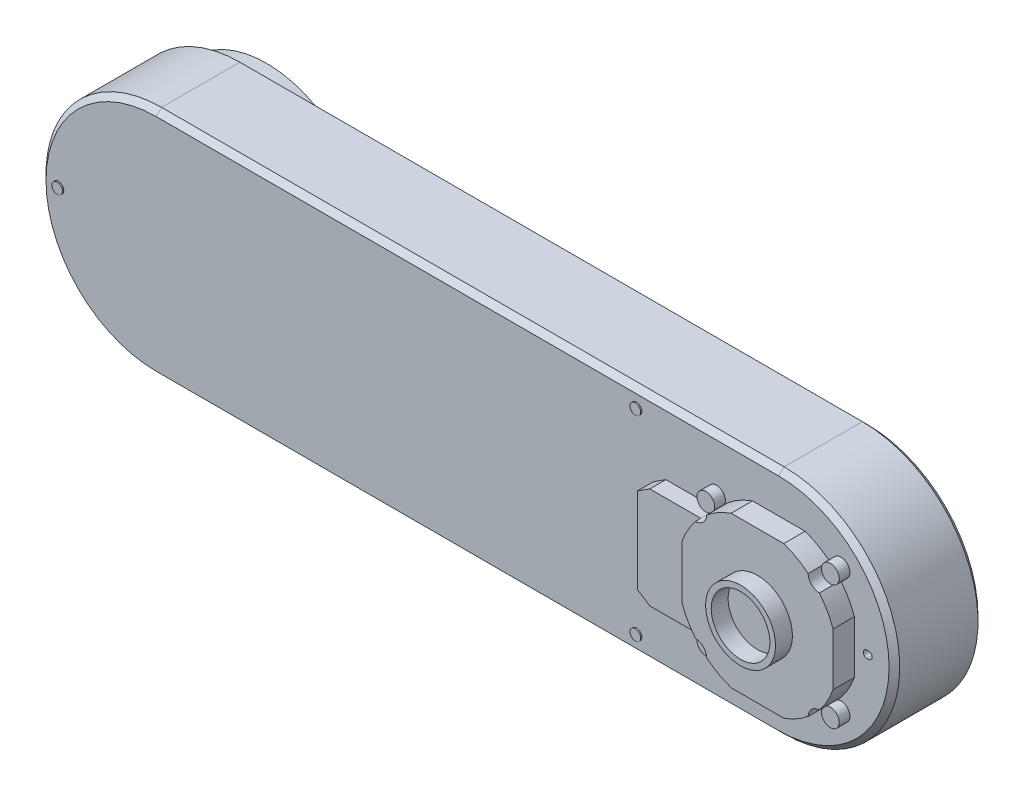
ISO-10303-21;
HEADER;
FILE_DESCRIPTION(('STEP AP214'),'2;1');
FILE_NAME('part.step','',(''),(''),'','','');
FILE_SCHEMA(('AUTOMOTIVE_DESIGN { 1 0 10303 214 1 1 1 1 }'));
ENDSEC;
DATA;
#1=APPLICATION_CONTEXT('core data for automotive mechanical design processes');
#2=APPLICATION_PROTOCOL_DEFINITION('international standard','automotive_design',2000,#1);
#3=PRODUCT_CONTEXT('',#1,'mechanical');
#4=PRODUCT('Part','Part','',(#3));
#5=PRODUCT_RELATED_PRODUCT_CATEGORY('part','',(#4));
#6=PRODUCT_DEFINITION_FORMATION('','',#4);
#7=PRODUCT_DEFINITION_CONTEXT('part definition',#1,'design');
#8=PRODUCT_DEFINITION('design','',#6,#7);
#9=PRODUCT_DEFINITION_SHAPE('','',#8);
#10=(LENGTH_UNIT() NAMED_UNIT(*) SI_UNIT(.MILLI.,.METRE.));
#11=(NAMED_UNIT(*) PLANE_ANGLE_UNIT() SI_UNIT($,.RADIAN.));
#12=(NAMED_UNIT(*) SI_UNIT($,.STERADIAN.) SOLID_ANGLE_UNIT());
#13=UNCERTAINTY_MEASURE_WITH_UNIT(LENGTH_MEASURE(1.E-05),#10,'distance_accuracy_value','');
#14=(GEOMETRIC_REPRESENTATION_CONTEXT(3) GLOBAL_UNCERTAINTY_ASSIGNED_CONTEXT((#13)) GLOBAL_UNIT_ASSIGNED_CONTEXT((#10,
#11,#12)) REPRESENTATION_CONTEXT('',''));
#15=CARTESIAN_POINT('',(0.,0.,0.));
#16=DIRECTION('',(0.,0.,1.));
#17=DIRECTION('',(1.,0.,0.));
#18=AXIS2_PLACEMENT_3D('',#15,#16,#17);
#19=CARTESIAN_POINT('',(350.,0.,0.));
#20=DIRECTION('',(0.,0.,1.));
#21=DIRECTION('',(1.,0.,0.));
#22=AXIS2_PLACEMENT_3D('',#19,#20,#21);
#23=PLANE('',#22);
#24=CARTESIAN_POINT('',(0.,0.,0.));
#25=DIRECTION('',(0.,0.,1.));
#26=DIRECTION('',(1.,0.,0.));
#27=AXIS2_PLACEMENT_3D('',#24,#25,#26);
#28=CIRCLE('',#27,34.6);
#29=CARTESIAN_POINT('',(34.6,0.,0.));
#30=VERTEX_POINT('',#29);
#31=EDGE_CURVE('E20',#30,#30,#28,.F.);
#32=ORIENTED_EDGE('',*,*,#31,.T.);
#33=EDGE_LOOP('',(#32));
#34=FACE_BOUND('',#33,.T.);
#35=ADVANCED_FACE('F17',(#34),#23,.F.);
#36=CARTESIAN_POINT('',(0.,0.,-12.));
#37=DIRECTION('',(0.,0.,1.));
#38=DIRECTION('',(1.,0.,0.));
#39=AXIS2_PLACEMENT_3D('',#36,#37,#38);
#40=CYLINDRICAL_SURFACE('',#39,34.6);
#41=CARTESIAN_POINT('',(0.,0.,-12.));
#42=DIRECTION('',(0.,0.,1.));
#43=DIRECTION('',(1.,0.,0.));
#44=AXIS2_PLACEMENT_3D('',#41,#42,#43);
#45=CIRCLE('',#44,34.6);
#46=CARTESIAN_POINT('',(34.6,0.,-12.));
#47=VERTEX_POINT('',#46);
#48=EDGE_CURVE('E392',#47,#47,#45,.F.);
#49=ORIENTED_EDGE('',*,*,#48,.T.);
#50=EDGE_LOOP('',(#49));
#51=FACE_BOUND('',#50,.T.);
#52=ORIENTED_EDGE('',*,*,#31,.F.);
#53=EDGE_LOOP('',(#52));
#54=FACE_BOUND('',#53,.T.);
#55=ADVANCED_FACE('F400',(#51,#54),#40,.F.);
#56=CARTESIAN_POINT('',(385.,35.,62.));
#57=DIRECTION('',(0.,0.,1.));
#58=DIRECTION('',(1.,0.,0.));
#59=AXIS2_PLACEMENT_3D('',#56,#57,#58);
#60=PLANE('',#59);
#61=CARTESIAN_POINT('',(350.,0.,62.));
#62=DIRECTION('',(0.,0.,-1.));
#63=DIRECTION('',(-1.,0.,0.));
#64=AXIS2_PLACEMENT_3D('',#61,#62,#63);
#65=CIRCLE('',#64,16.5);
#66=CARTESIAN_POINT('',(333.5,0.,62.));
#67=VERTEX_POINT('',#66);
#68=EDGE_CURVE('E390',#67,#67,#65,.F.);
#69=ORIENTED_EDGE('',*,*,#68,.T.);
#70=EDGE_LOOP('',(#69));
#71=FACE_BOUND('',#70,.T.);
#72=ADVANCED_FACE('F402',(#71),#60,.T.);
#73=CARTESIAN_POINT('',(85.,0.,5.));
#74=DIRECTION('',(0.,0.,-1.));
#75=DIRECTION('',(-1.,0.,0.));
#76=AXIS2_PLACEMENT_3D('',#73,#74,#75);
#77=PLANE('',#76);
#78=CARTESIAN_POINT('',(85.,0.,5.));
#79=DIRECTION('',(0.,0.,-1.));
#80=DIRECTION('',(-1.,0.,0.));
#81=AXIS2_PLACEMENT_3D('',#78,#79,#80);
#82=CIRCLE('',#81,2.);
#83=CARTESIAN_POINT('',(83.,0.,5.));
#84=VERTEX_POINT('',#83);
#85=EDGE_CURVE('E387',#84,#84,#82,.T.);
#86=ORIENTED_EDGE('',*,*,#85,.T.);
#87=EDGE_LOOP('',(#86));
#88=FACE_BOUND('',#87,.T.);
#89=ADVANCED_FACE('F408',(#88),#77,.T.);
#90=CARTESIAN_POINT('',(70.,0.,5.));
#91=DIRECTION('',(0.,0.,-1.));
#92=DIRECTION('',(-1.,0.,0.));
#93=AXIS2_PLACEMENT_3D('',#90,#91,#92);
#94=PLANE('',#93);
#95=CARTESIAN_POINT('',(70.,0.,5.));
#96=DIRECTION('',(0.,0.,-1.));
#97=DIRECTION('',(-1.,0.,0.));
#98=AXIS2_PLACEMENT_3D('',#95,#96,#97);
#99=CIRCLE('',#98,2.);
#100=CARTESIAN_POINT('',(68.,0.,5.));
#101=VERTEX_POINT('',#100);
#102=EDGE_CURVE('E384',#101,#101,#99,.T.);
#103=ORIENTED_EDGE('',*,*,#102,.T.);
#104=EDGE_LOOP('',(#103));
#105=FACE_BOUND('',#104,.T.);
#106=ADVANCED_FACE('F700',(#105),#94,.T.);
#107=CARTESIAN_POINT('',(325.,55.,-0.7));
#108=DIRECTION('',(0.,0.,1.));
#109=DIRECTION('',(1.,0.,0.));
#110=AXIS2_PLACEMENT_3D('',#107,#108,#109);
#111=PLANE('',#110);
#112=CARTESIAN_POINT('',(325.,55.,-0.7));
#113=DIRECTION('',(0.,0.,1.));
#114=DIRECTION('',(1.,0.,0.));
#115=AXIS2_PLACEMENT_3D('',#112,#113,#114);
#116=CIRCLE('',#115,3.);
#117=CARTESIAN_POINT('',(328.,55.,-0.7));
#118=VERTEX_POINT('',#117);
#119=EDGE_CURVE('E381',#118,#118,#116,.T.);
#120=ORIENTED_EDGE('',*,*,#119,.F.);
#121=EDGE_LOOP('',(#120));
#122=FACE_BOUND('',#121,.T.);
#123=ADVANCED_FACE('F696',(#122),#111,.F.);
#124=CARTESIAN_POINT('',(325.,-55.,-0.7));
#125=DIRECTION('',(0.,0.,1.));
#126=DIRECTION('',(1.,0.,0.));
#127=AXIS2_PLACEMENT_3D('',#124,#125,#126);
#128=PLANE('',#127);
#129=CARTESIAN_POINT('',(325.,-55.,-0.7));
#130=DIRECTION('',(0.,0.,1.));
#131=DIRECTION('',(1.,0.,0.));
#132=AXIS2_PLACEMENT_3D('',#129,#130,#131);
#133=CIRCLE('',#132,3.);
#134=CARTESIAN_POINT('',(328.,-55.,-0.7));
#135=VERTEX_POINT('',#134);
#136=EDGE_CURVE('E378',#135,#135,#133,.T.);
#137=ORIENTED_EDGE('',*,*,#136,.F.);
#138=EDGE_LOOP('',(#137));
#139=FACE_BOUND('',#138,.T.);
#140=ADVANCED_FACE('F692',(#139),#128,.F.);
#141=CARTESIAN_POINT('',(405.,0.,-0.7));
#142=DIRECTION('',(0.,0.,1.));
#143=DIRECTION('',(1.,0.,0.));
#144=AXIS2_PLACEMENT_3D('',#141,#142,#143);
#145=PLANE('',#144);
#146=CARTESIAN_POINT('',(405.,0.,-0.7));
#147=DIRECTION('',(0.,0.,1.));
#148=DIRECTION('',(1.,0.,0.));
#149=AXIS2_PLACEMENT_3D('',#146,#147,#148);
#150=CIRCLE('',#149,3.);
#151=CARTESIAN_POINT('',(408.,0.,-0.7));
#152=VERTEX_POINT('',#151);
#153=EDGE_CURVE('E375',#152,#152,#150,.T.);
#154=ORIENTED_EDGE('',*,*,#153,.F.);
#155=EDGE_LOOP('',(#154));
#156=FACE_BOUND('',#155,.T.);
#157=ADVANCED_FACE('F688',(#156),#145,.F.);
#158=CARTESIAN_POINT('',(0.,0.,-12.));
#159=DIRECTION('',(0.,0.,1.));
#160=DIRECTION('',(1.,0.,0.));
#161=AXIS2_PLACEMENT_3D('',#158,#159,#160);
#162=PLANE('',#161);
#163=CARTESIAN_POINT('',(0.,0.,-12.));
#164=DIRECTION('',(0.,0.,1.));
#165=DIRECTION('',(1.,0.,0.));
#166=AXIS2_PLACEMENT_3D('',#163,#164,#165);
#167=CIRCLE('',#166,57.);
#168=CARTESIAN_POINT('',(57.,0.,-12.));
#169=VERTEX_POINT('',#168);
#170=EDGE_CURVE('E372',#169,#169,#167,.T.);
#171=ORIENTED_EDGE('',*,*,#170,.F.);
#172=EDGE_LOOP('',(#171));
#173=FACE_BOUND('',#172,.T.);
#174=ORIENTED_EDGE('',*,*,#48,.F.);
#175=EDGE_LOOP('',(#174));
#176=FACE_BOUND('',#175,.T.);
#177=ADVANCED_FACE('F684',(#173,#176),#162,.F.);
#178=CARTESIAN_POINT('',(350.,0.,71.5));
#179=DIRECTION('',(0.,0.,-1.));
#180=DIRECTION('',(-1.,0.,0.));
#181=AXIS2_PLACEMENT_3D('',#178,#179,#180);
#182=CYLINDRICAL_SURFACE('',#181,16.5);
#183=CARTESIAN_POINT('',(350.,0.,71.5));
#184=DIRECTION('',(0.,0.,-1.));
#185=DIRECTION('',(-1.,0.,0.));
#186=AXIS2_PLACEMENT_3D('',#183,#184,#185);
#187=CIRCLE('',#186,16.5);
#188=CARTESIAN_POINT('',(333.5,0.,71.5));
#189=VERTEX_POINT('',#188);
#190=EDGE_CURVE('E369',#189,#189,#187,.T.);
#191=ORIENTED_EDGE('',*,*,#190,.F.);
#192=EDGE_LOOP('',(#191));
#193=FACE_BOUND('',#192,.T.);
#194=ORIENTED_EDGE('',*,*,#68,.F.);
#195=EDGE_LOOP('',(#194));
#196=FACE_BOUND('',#195,.T.);
#197=ADVANCED_FACE('F680',(#193,#196),#182,.F.);
#198=CARTESIAN_POINT('',(85.,0.,5.));
#199=DIRECTION('',(0.,0.,-1.));
#200=DIRECTION('',(-1.,0.,0.));
#201=AXIS2_PLACEMENT_3D('',#198,#199,#200);
#202=CYLINDRICAL_SURFACE('',#201,2.);
#203=ORIENTED_EDGE('',*,*,#85,.F.);
#204=EDGE_LOOP('',(#203));
#205=FACE_BOUND('',#204,.T.);
#206=CARTESIAN_POINT('',(85.,0.,0.));
#207=DIRECTION('',(0.,0.,-1.));
#208=DIRECTION('',(-1.,0.,0.));
#209=AXIS2_PLACEMENT_3D('',#206,#207,#208);
#210=CIRCLE('',#209,2.);
#211=CARTESIAN_POINT('',(83.,0.,0.));
#212=VERTEX_POINT('',#211);
#213=EDGE_CURVE('E366',#212,#212,#210,.T.);
#214=ORIENTED_EDGE('',*,*,#213,.T.);
#215=EDGE_LOOP('',(#214));
#216=FACE_BOUND('',#215,.T.);
#217=ADVANCED_FACE('F676',(#205,#216),#202,.F.);
#218=CARTESIAN_POINT('',(70.,0.,5.));
#219=DIRECTION('',(0.,0.,-1.));
#220=DIRECTION('',(-1.,0.,0.));
#221=AXIS2_PLACEMENT_3D('',#218,#219,#220);
#222=CYLINDRICAL_SURFACE('',#221,2.);
#223=ORIENTED_EDGE('',*,*,#102,.F.);
#224=EDGE_LOOP('',(#223));
#225=FACE_BOUND('',#224,.T.);
#226=CARTESIAN_POINT('',(70.,0.,0.));
#227=DIRECTION('',(0.,0.,-1.));
#228=DIRECTION('',(-1.,0.,0.));
#229=AXIS2_PLACEMENT_3D('',#226,#227,#228);
#230=CIRCLE('',#229,2.);
#231=CARTESIAN_POINT('',(68.,0.,0.));
#232=VERTEX_POINT('',#231);
#233=EDGE_CURVE('E363',#232,#232,#230,.T.);
#234=ORIENTED_EDGE('',*,*,#233,.T.);
#235=EDGE_LOOP('',(#234));
#236=FACE_BOUND('',#235,.T.);
#237=ADVANCED_FACE('F672',(#225,#236),#222,.F.);
#238=CARTESIAN_POINT('',(325.,55.,-0.7));
#239=DIRECTION('',(0.,0.,1.));
#240=DIRECTION('',(1.,0.,0.));
#241=AXIS2_PLACEMENT_3D('',#238,#239,#240);
#242=CYLINDRICAL_SURFACE('',#241,3.);
#243=CARTESIAN_POINT('',(325.,55.,0.));
#244=DIRECTION('',(0.,0.,1.));
#245=DIRECTION('',(1.,0.,0.));
#246=AXIS2_PLACEMENT_3D('',#243,#244,#245);
#247=CIRCLE('',#246,3.);
#248=CARTESIAN_POINT('',(328.,55.,0.));
#249=VERTEX_POINT('',#248);
#250=EDGE_CURVE('E360',#249,#249,#247,.F.);
#251=ORIENTED_EDGE('',*,*,#250,.T.);
#252=EDGE_LOOP('',(#251));
#253=FACE_BOUND('',#252,.T.);
#254=ORIENTED_EDGE('',*,*,#119,.T.);
#255=EDGE_LOOP('',(#254));
#256=FACE_BOUND('',#255,.T.);
#257=ADVANCED_FACE('F668',(#253,#256),#242,.T.);
#258=CARTESIAN_POINT('',(325.,-55.,-0.7));
#259=DIRECTION('',(0.,0.,1.));
#260=DIRECTION('',(1.,0.,0.));
#261=AXIS2_PLACEMENT_3D('',#258,#259,#260);
#262=CYLINDRICAL_SURFACE('',#261,3.);
#263=CARTESIAN_POINT('',(325.,-55.,0.));
#264=DIRECTION('',(0.,0.,1.));
#265=DIRECTION('',(1.,0.,0.));
#266=AXIS2_PLACEMENT_3D('',#263,#264,#265);
#267=CIRCLE('',#266,3.);
#268=CARTESIAN_POINT('',(328.,-55.,0.));
#269=VERTEX_POINT('',#268);
#270=EDGE_CURVE('E357',#269,#269,#267,.F.);
#271=ORIENTED_EDGE('',*,*,#270,.T.);
#272=EDGE_LOOP('',(#271));
#273=FACE_BOUND('',#272,.T.);
#274=ORIENTED_EDGE('',*,*,#136,.T.);
#275=EDGE_LOOP('',(#274));
#276=FACE_BOUND('',#275,.T.);
#277=ADVANCED_FACE('F664',(#273,#276),#262,.T.);
#278=CARTESIAN_POINT('',(405.,0.,-0.7));
#279=DIRECTION('',(0.,0.,1.));
#280=DIRECTION('',(1.,0.,0.));
#281=AXIS2_PLACEMENT_3D('',#278,#279,#280);
#282=CYLINDRICAL_SURFACE('',#281,3.);
#283=CARTESIAN_POINT('',(405.,0.,0.));
#284=DIRECTION('',(0.,0.,1.));
#285=DIRECTION('',(1.,0.,0.));
#286=AXIS2_PLACEMENT_3D('',#283,#284,#285);
#287=CIRCLE('',#286,3.);
#288=CARTESIAN_POINT('',(408.,0.,0.));
#289=VERTEX_POINT('',#288);
#290=EDGE_CURVE('E354',#289,#289,#287,.F.);
#291=ORIENTED_EDGE('',*,*,#290,.T.);
#292=EDGE_LOOP('',(#291));
#293=FACE_BOUND('',#292,.T.);
#294=ORIENTED_EDGE('',*,*,#153,.T.);
#295=EDGE_LOOP('',(#294));
#296=FACE_BOUND('',#295,.T.);
#297=ADVANCED_FACE('F660',(#293,#296),#282,.T.);
#298=CARTESIAN_POINT('',(0.,0.,-12.));
#299=DIRECTION('',(0.,0.,1.));
#300=DIRECTION('',(1.,0.,0.));
#301=AXIS2_PLACEMENT_3D('',#298,#299,#300);
#302=CYLINDRICAL_SURFACE('',#301,57.);
#303=CARTESIAN_POINT('',(0.,0.,0.));
#304=DIRECTION('',(0.,0.,1.));
#305=DIRECTION('',(1.,0.,0.));
#306=AXIS2_PLACEMENT_3D('',#303,#304,#305);
#307=CIRCLE('',#306,57.);
#308=CARTESIAN_POINT('',(57.,0.,0.));
#309=VERTEX_POINT('',#308);
#310=EDGE_CURVE('E351',#309,#309,#307,.F.);
#311=ORIENTED_EDGE('',*,*,#310,.T.);
#312=EDGE_LOOP('',(#311));
#313=FACE_BOUND('',#312,.T.);
#314=ORIENTED_EDGE('',*,*,#170,.T.);
#315=EDGE_LOOP('',(#314));
#316=FACE_BOUND('',#315,.T.);
#317=ADVANCED_FACE('F656',(#313,#316),#302,.T.);
#318=CARTESIAN_POINT('',(350.,0.,71.5));
#319=DIRECTION('',(0.,0.,1.));
#320=DIRECTION('',(1.,0.,0.));
#321=AXIS2_PLACEMENT_3D('',#318,#319,#320);
#322=PLANE('',#321);
#323=ORIENTED_EDGE('',*,*,#190,.T.);
#324=EDGE_LOOP('',(#323));
#325=FACE_BOUND('',#324,.T.);
#326=CARTESIAN_POINT('',(350.,0.,71.5));
#327=DIRECTION('',(0.,0.,-1.));
#328=DIRECTION('',(-1.,0.,0.));
#329=AXIS2_PLACEMENT_3D('',#326,#327,#328);
#330=CIRCLE('',#329,19.65);
#331=CARTESIAN_POINT('',(330.35,0.,71.5));
#332=VERTEX_POINT('',#331);
#333=EDGE_CURVE('E147',#332,#332,#330,.T.);
#334=ORIENTED_EDGE('',*,*,#333,.F.);
#335=EDGE_LOOP('',(#334));
#336=FACE_BOUND('',#335,.T.);
#337=ADVANCED_FACE('F652',(#325,#336),#322,.T.);
#338=CARTESIAN_POINT('',(350.,0.,0.));
#339=DIRECTION('',(0.,0.,1.));
#340=DIRECTION('',(1.,0.,0.));
#341=AXIS2_PLACEMENT_3D('',#338,#339,#340);
#342=PLANE('',#341);
#343=ORIENTED_EDGE('',*,*,#310,.F.);
#344=EDGE_LOOP('',(#343));
#345=FACE_BOUND('',#344,.T.);
#346=DIRECTION('',(1.,0.,0.));
#347=VECTOR('',#346,1.);
#348=CARTESIAN_POINT('',(0.,62.,0.));
#349=LINE('',#348,#347);
#350=CARTESIAN_POINT('',(0.,62.,0.));
#351=VERTEX_POINT('',#350);
#352=CARTESIAN_POINT('',(350.,62.,0.));
#353=VERTEX_POINT('',#352);
#354=EDGE_CURVE('E125',#351,#353,#349,.T.);
#355=ORIENTED_EDGE('',*,*,#354,.T.);
#356=CARTESIAN_POINT('',(350.,0.,0.));
#357=DIRECTION('',(0.,0.,1.));
#358=DIRECTION('',(0.,-1.,0.));
#359=AXIS2_PLACEMENT_3D('',#356,#357,#358);
#360=CIRCLE('',#359,62.);
#361=CARTESIAN_POINT('',(350.,-62.,0.));
#362=VERTEX_POINT('',#361);
#363=EDGE_CURVE('E129',#362,#353,#360,.T.);
#364=ORIENTED_EDGE('',*,*,#363,.F.);
#365=DIRECTION('',(1.,0.,0.));
#366=VECTOR('',#365,1.);
#367=CARTESIAN_POINT('',(0.,-62.,0.));
#368=LINE('',#367,#366);
#369=CARTESIAN_POINT('',(0.,-62.,0.));
#370=VERTEX_POINT('',#369);
#371=EDGE_CURVE('E162',#362,#370,#368,.F.);
#372=ORIENTED_EDGE('',*,*,#371,.T.);
#373=CARTESIAN_POINT('',(0.,0.,0.));
#374=DIRECTION('',(0.,0.,1.));
#375=DIRECTION('',(0.,-1.,0.));
#376=AXIS2_PLACEMENT_3D('',#373,#374,#375);
#377=CIRCLE('',#376,62.);
#378=EDGE_CURVE('E132',#351,#370,#377,.T.);
#379=ORIENTED_EDGE('',*,*,#378,.F.);
#380=EDGE_LOOP('',(#355,#364,#372,#379));
#381=FACE_BOUND('',#380,.T.);
#382=ORIENTED_EDGE('',*,*,#290,.F.);
#383=EDGE_LOOP('',(#382));
#384=FACE_BOUND('',#383,.T.);
#385=ORIENTED_EDGE('',*,*,#270,.F.);
#386=EDGE_LOOP('',(#385));
#387=FACE_BOUND('',#386,.T.);
#388=ORIENTED_EDGE('',*,*,#250,.F.);
#389=EDGE_LOOP('',(#388));
#390=FACE_BOUND('',#389,.T.);
#391=ORIENTED_EDGE('',*,*,#233,.F.);
#392=EDGE_LOOP('',(#391));
#393=FACE_BOUND('',#392,.T.);
#394=ORIENTED_EDGE('',*,*,#213,.F.);
#395=EDGE_LOOP('',(#394));
#396=FACE_BOUND('',#395,.T.);
#397=ADVANCED_FACE('F127',(#345,#381,#384,#387,#390,#393,#396),#342,.F.);
#398=CARTESIAN_POINT('',(350.,0.,71.5));
#399=DIRECTION('',(0.,0.,-1.));
#400=DIRECTION('',(-1.,0.,0.));
#401=AXIS2_PLACEMENT_3D('',#398,#399,#400);
#402=CYLINDRICAL_SURFACE('',#401,19.65);
#403=CARTESIAN_POINT('',(350.,0.,62.));
#404=DIRECTION('',(0.,0.,-1.));
#405=DIRECTION('',(-1.,0.,0.));
#406=AXIS2_PLACEMENT_3D('',#403,#404,#405);
#407=CIRCLE('',#406,19.65);
#408=CARTESIAN_POINT('',(330.35,0.,62.));
#409=VERTEX_POINT('',#408);
#410=EDGE_CURVE('E344',#409,#409,#407,.T.);
#411=ORIENTED_EDGE('',*,*,#410,.F.);
#412=EDGE_LOOP('',(#411));
#413=FACE_BOUND('',#412,.T.);
#414=ORIENTED_EDGE('',*,*,#333,.T.);
#415=EDGE_LOOP('',(#414));
#416=FACE_BOUND('',#415,.T.);
#417=ADVANCED_FACE('F646',(#413,#416),#402,.T.);
#418=CARTESIAN_POINT('',(350.,0.,3.));
#419=DIRECTION('',(0.,0.,1.));
#420=DIRECTION('',(0.,-1.,0.));
#421=AXIS2_PLACEMENT_3D('',#418,#419,#420);
#422=CONICAL_SURFACE('',#421,65.,0.785398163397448);
#423=DIRECTION('',(0.,-0.707106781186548,-0.707106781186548));
#424=VECTOR('',#423,1.);
#425=CARTESIAN_POINT('',(350.,65.,3.));
#426=LINE('',#425,#424);
#427=CARTESIAN_POINT('',(350.,65.,3.));
#428=VERTEX_POINT('',#427);
#429=EDGE_CURVE('E137',#353,#428,#426,.F.);
#430=ORIENTED_EDGE('',*,*,#429,.T.);
#431=CARTESIAN_POINT('',(350.,0.,3.));
#432=DIRECTION('',(0.,0.,-1.));
#433=DIRECTION('',(-1.,0.,0.));
#434=AXIS2_PLACEMENT_3D('',#431,#432,#433);
#435=CIRCLE('',#434,65.);
#436=CARTESIAN_POINT('',(350.,-65.,3.));
#437=VERTEX_POINT('',#436);
#438=EDGE_CURVE('E1226',#437,#428,#435,.F.);
#439=ORIENTED_EDGE('',*,*,#438,.F.);
#440=DIRECTION('',(0.,-0.707106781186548,0.707106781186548));
#441=VECTOR('',#440,1.);
#442=CARTESIAN_POINT('',(350.,-65.,3.));
#443=LINE('',#442,#441);
#444=EDGE_CURVE('E145',#437,#362,#443,.F.);
#445=ORIENTED_EDGE('',*,*,#444,.T.);
#446=ORIENTED_EDGE('',*,*,#363,.T.);
#447=EDGE_LOOP('',(#430,#439,#445,#446));
#448=FACE_BOUND('',#447,.T.);
#449=ADVANCED_FACE('F141',(#448),#422,.T.);
#450=CARTESIAN_POINT('',(0.,65.,3.));
#451=DIRECTION('',(0.,-0.707106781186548,0.707106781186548));
#452=DIRECTION('',(0.,-0.707106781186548,-0.707106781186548));
#453=AXIS2_PLACEMENT_3D('',#450,#451,#452);
#454=PLANE('',#453);
#455=ORIENTED_EDGE('',*,*,#354,.F.);
#456=DIRECTION('',(0.,-0.707106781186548,-0.707106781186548));
#457=VECTOR('',#456,1.);
#458=CARTESIAN_POINT('',(0.,65.,3.));
#459=LINE('',#458,#457);
#460=CARTESIAN_POINT('',(0.,65.,3.));
#461=VERTEX_POINT('',#460);
#462=EDGE_CURVE('E153',#461,#351,#459,.T.);
#463=ORIENTED_EDGE('',*,*,#462,.F.);
#464=DIRECTION('',(1.,0.,0.));
#465=VECTOR('',#464,1.);
#466=CARTESIAN_POINT('',(0.,65.,3.));
#467=LINE('',#466,#465);
#468=EDGE_CURVE('E151',#461,#428,#467,.T.);
#469=ORIENTED_EDGE('',*,*,#468,.T.);
#470=ORIENTED_EDGE('',*,*,#429,.F.);
#471=EDGE_LOOP('',(#455,#463,#469,#470));
#472=FACE_BOUND('',#471,.T.);
#473=ADVANCED_FACE('F149',(#472),#454,.F.);
#474=CARTESIAN_POINT('',(0.,0.,3.));
#475=DIRECTION('',(0.,0.,1.));
#476=DIRECTION('',(0.,-1.,0.));
#477=AXIS2_PLACEMENT_3D('',#474,#475,#476);
#478=CONICAL_SURFACE('',#477,65.,0.785398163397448);
#479=ORIENTED_EDGE('',*,*,#462,.T.);
#480=ORIENTED_EDGE('',*,*,#378,.T.);
#481=DIRECTION('',(0.,-0.707106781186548,0.707106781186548));
#482=VECTOR('',#481,1.);
#483=CARTESIAN_POINT('',(0.,-65.,3.));
#484=LINE('',#483,#482);
#485=CARTESIAN_POINT('',(0.,-65.,3.));
#486=VERTEX_POINT('',#485);
#487=EDGE_CURVE('E163',#370,#486,#484,.T.);
#488=ORIENTED_EDGE('',*,*,#487,.T.);
#489=CARTESIAN_POINT('',(0.,0.,3.));
#490=DIRECTION('',(0.,0.,-1.));
#491=DIRECTION('',(-1.,0.,0.));
#492=AXIS2_PLACEMENT_3D('',#489,#490,#491);
#493=CIRCLE('',#492,65.);
#494=EDGE_CURVE('E1214',#461,#486,#493,.F.);
#495=ORIENTED_EDGE('',*,*,#494,.F.);
#496=EDGE_LOOP('',(#479,#480,#488,#495));
#497=FACE_BOUND('',#496,.T.);
#498=ADVANCED_FACE('F637',(#497),#478,.T.);
#499=CARTESIAN_POINT('',(0.,-65.,3.));
#500=DIRECTION('',(0.,0.707106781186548,0.707106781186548));
#501=DIRECTION('',(0.,-0.707106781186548,0.707106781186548));
#502=AXIS2_PLACEMENT_3D('',#499,#500,#501);
#503=PLANE('',#502);
#504=ORIENTED_EDGE('',*,*,#371,.F.);
#505=ORIENTED_EDGE('',*,*,#444,.F.);
#506=DIRECTION('',(1.,0.,0.));
#507=VECTOR('',#506,1.);
#508=CARTESIAN_POINT('',(0.,-65.,3.));
#509=LINE('',#508,#507);
#510=EDGE_CURVE('E1269',#437,#486,#509,.F.);
#511=ORIENTED_EDGE('',*,*,#510,.T.);
#512=ORIENTED_EDGE('',*,*,#487,.F.);
#513=EDGE_LOOP('',(#504,#505,#511,#512));
#514=FACE_BOUND('',#513,.T.);
#515=ADVANCED_FACE('F633',(#514),#503,.F.);
#516=CARTESIAN_POINT('',(315.,35.,56.));
#517=DIRECTION('',(0.,0.,1.));
#518=DIRECTION('',(1.,0.,0.));
#519=AXIS2_PLACEMENT_3D('',#516,#517,#518);
#520=PLANE('',#519);
#521=CARTESIAN_POINT('',(315.,35.,56.));
#522=DIRECTION('',(0.,0.,-1.));
#523=DIRECTION('',(-1.,0.,0.));
#524=AXIS2_PLACEMENT_3D('',#521,#522,#523);
#525=CIRCLE('',#524,5.);
#526=CARTESIAN_POINT('',(310.,35.,56.));
#527=VERTEX_POINT('',#526);
#528=EDGE_CURVE('E337',#527,#527,#525,.T.);
#529=ORIENTED_EDGE('',*,*,#528,.F.);
#530=EDGE_LOOP('',(#529));
#531=FACE_BOUND('',#530,.T.);
#532=ADVANCED_FACE('F629',(#531),#520,.T.);
#533=CARTESIAN_POINT('',(385.,35.,56.));
#534=DIRECTION('',(0.,0.,1.));
#535=DIRECTION('',(1.,0.,0.));
#536=AXIS2_PLACEMENT_3D('',#533,#534,#535);
#537=PLANE('',#536);
#538=CARTESIAN_POINT('',(385.,35.,56.));
#539=DIRECTION('',(0.,0.,-1.));
#540=DIRECTION('',(-1.,0.,0.));
#541=AXIS2_PLACEMENT_3D('',#538,#539,#540);
#542=CIRCLE('',#541,5.);
#543=CARTESIAN_POINT('',(380.,35.,56.));
#544=VERTEX_POINT('',#543);
#545=EDGE_CURVE('E332',#544,#544,#542,.T.);
#546=ORIENTED_EDGE('',*,*,#545,.F.);
#547=EDGE_LOOP('',(#546));
#548=FACE_BOUND('',#547,.T.);
#549=ADVANCED_FACE('F625',(#548),#537,.T.);
#550=CARTESIAN_POINT('',(385.,-35.,56.));
#551=DIRECTION('',(0.,0.,1.));
#552=DIRECTION('',(1.,0.,0.));
#553=AXIS2_PLACEMENT_3D('',#550,#551,#552);
#554=PLANE('',#553);
#555=CARTESIAN_POINT('',(385.,-35.,56.));
#556=DIRECTION('',(0.,0.,-1.));
#557=DIRECTION('',(-1.,0.,0.));
#558=AXIS2_PLACEMENT_3D('',#555,#556,#557);
#559=CIRCLE('',#558,5.);
#560=CARTESIAN_POINT('',(380.,-35.,56.));
#561=VERTEX_POINT('',#560);
#562=EDGE_CURVE('E328',#561,#561,#559,.T.);
#563=ORIENTED_EDGE('',*,*,#562,.F.);
#564=EDGE_LOOP('',(#563));
#565=FACE_BOUND('',#564,.T.);
#566=ADVANCED_FACE('F621',(#565),#554,.T.);
#567=CARTESIAN_POINT('',(315.,-35.,56.));
#568=DIRECTION('',(0.,0.,1.));
#569=DIRECTION('',(1.,0.,0.));
#570=AXIS2_PLACEMENT_3D('',#567,#568,#569);
#571=PLANE('',#570);
#572=CARTESIAN_POINT('',(315.,-35.,56.));
#573=DIRECTION('',(0.,0.,-1.));
#574=DIRECTION('',(-1.,0.,0.));
#575=AXIS2_PLACEMENT_3D('',#572,#573,#574);
#576=CIRCLE('',#575,5.);
#577=CARTESIAN_POINT('',(310.,-35.,56.));
#578=VERTEX_POINT('',#577);
#579=EDGE_CURVE('E295',#578,#578,#576,.T.);
#580=ORIENTED_EDGE('',*,*,#579,.F.);
#581=EDGE_LOOP('',(#580));
#582=FACE_BOUND('',#581,.T.);
#583=ADVANCED_FACE('F617',(#582),#571,.T.);
#584=CARTESIAN_POINT('',(307.5,14.7901994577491,62.));
#585=DIRECTION('',(1.,0.,0.));
#586=DIRECTION('',(0.,0.,-1.));
#587=AXIS2_PLACEMENT_3D('',#584,#585,#586);
#588=PLANE('',#587);
#589=DIRECTION('',(0.,1.,0.));
#590=VECTOR('',#589,1.);
#591=CARTESIAN_POINT('',(307.5,0.,59.));
#592=LINE('',#591,#590);
#593=CARTESIAN_POINT('',(307.5,-14.790199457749,59.));
#594=VERTEX_POINT('',#593);
#595=CARTESIAN_POINT('',(307.5,14.790199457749,59.));
#596=VERTEX_POINT('',#595);
#597=EDGE_CURVE('E274',#594,#596,#592,.T.);
#598=ORIENTED_EDGE('',*,*,#597,.F.);
#599=DIRECTION('',(0.,0.,-1.));
#600=VECTOR('',#599,1.);
#601=CARTESIAN_POINT('',(307.5,-14.7901994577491,62.));
#602=LINE('',#601,#600);
#603=CARTESIAN_POINT('',(307.5,-14.790199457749,62.));
#604=VERTEX_POINT('',#603);
#605=EDGE_CURVE('E284',#604,#594,#602,.T.);
#606=ORIENTED_EDGE('',*,*,#605,.F.);
#607=DIRECTION('',(0.,1.,0.));
#608=VECTOR('',#607,1.);
#609=CARTESIAN_POINT('',(307.5,35.,62.));
#610=LINE('',#609,#608);
#611=CARTESIAN_POINT('',(307.5,14.790199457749,62.));
#612=VERTEX_POINT('',#611);
#613=EDGE_CURVE('E311',#612,#604,#610,.F.);
#614=ORIENTED_EDGE('',*,*,#613,.F.);
#615=DIRECTION('',(0.,0.,-1.));
#616=VECTOR('',#615,1.);
#617=CARTESIAN_POINT('',(307.5,14.7901994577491,62.));
#618=LINE('',#617,#616);
#619=EDGE_CURVE('E1262',#596,#612,#618,.F.);
#620=ORIENTED_EDGE('',*,*,#619,.F.);
#621=EDGE_LOOP('',(#598,#606,#614,#620));
#622=FACE_BOUND('',#621,.T.);
#623=ADVANCED_FACE('F613',(#622),#588,.F.);
#624=CARTESIAN_POINT('',(399.5,2.00000000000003,45.));
#625=DIRECTION('',(0.,1.,0.));
#626=DIRECTION('',(0.,0.,1.));
#627=AXIS2_PLACEMENT_3D('',#624,#625,#626);
#628=PLANE('',#627);
#629=DIRECTION('',(0.,0.,1.));
#630=VECTOR('',#629,1.);
#631=CARTESIAN_POINT('',(399.5,2.00000000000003,45.));
#632=LINE('',#631,#630);
#633=CARTESIAN_POINT('',(399.5,2.00000000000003,50.));
#634=VERTEX_POINT('',#633);
#635=CARTESIAN_POINT('',(399.5,2.00000000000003,45.));
#636=VERTEX_POINT('',#635);
#637=EDGE_CURVE('E258',#634,#636,#632,.F.);
#638=ORIENTED_EDGE('',*,*,#637,.T.);
#639=DIRECTION('',(1.,0.,0.));
#640=VECTOR('',#639,1.);
#641=CARTESIAN_POINT('',(399.5,2.00000000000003,45.));
#642=LINE('',#641,#640);
#643=CARTESIAN_POINT('',(400.5,2.00000000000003,45.));
#644=VERTEX_POINT('',#643);
#645=EDGE_CURVE('E1251',#644,#636,#642,.F.);
#646=ORIENTED_EDGE('',*,*,#645,.F.);
#647=DIRECTION('',(0.,0.,1.));
#648=VECTOR('',#647,1.);
#649=CARTESIAN_POINT('',(400.5,2.00000000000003,45.));
#650=LINE('',#649,#648);
#651=CARTESIAN_POINT('',(400.5,2.00000000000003,50.));
#652=VERTEX_POINT('',#651);
#653=EDGE_CURVE('E1447',#644,#652,#650,.T.);
#654=ORIENTED_EDGE('',*,*,#653,.T.);
#655=DIRECTION('',(1.,0.,0.));
#656=VECTOR('',#655,1.);
#657=CARTESIAN_POINT('',(399.5,2.00000000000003,50.));
#658=LINE('',#657,#656);
#659=EDGE_CURVE('E347',#634,#652,#658,.T.);
#660=ORIENTED_EDGE('',*,*,#659,.F.);
#661=EDGE_LOOP('',(#638,#646,#654,#660));
#662=FACE_BOUND('',#661,.T.);
#663=ADVANCED_FACE('F609',(#662),#628,.F.);
#664=CARTESIAN_POINT('',(399.5,-1.99999999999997,45.));
#665=DIRECTION('',(0.,-1.,0.));
#666=DIRECTION('',(0.,0.,-1.));
#667=AXIS2_PLACEMENT_3D('',#664,#665,#666);
#668=PLANE('',#667);
#669=DIRECTION('',(0.,0.,1.));
#670=VECTOR('',#669,1.);
#671=CARTESIAN_POINT('',(400.5,-1.99999999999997,45.));
#672=LINE('',#671,#670);
#673=CARTESIAN_POINT('',(400.5,-1.99999999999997,50.));
#674=VERTEX_POINT('',#673);
#675=CARTESIAN_POINT('',(400.5,-1.99999999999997,45.));
#676=VERTEX_POINT('',#675);
#677=EDGE_CURVE('E253',#674,#676,#672,.F.);
#678=ORIENTED_EDGE('',*,*,#677,.T.);
#679=DIRECTION('',(1.,0.,0.));
#680=VECTOR('',#679,1.);
#681=CARTESIAN_POINT('',(399.5,-1.99999999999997,45.));
#682=LINE('',#681,#680);
#683=CARTESIAN_POINT('',(399.5,-1.99999999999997,45.));
#684=VERTEX_POINT('',#683);
#685=EDGE_CURVE('E1254',#684,#676,#682,.T.);
#686=ORIENTED_EDGE('',*,*,#685,.F.);
#687=DIRECTION('',(0.,0.,1.));
#688=VECTOR('',#687,1.);
#689=CARTESIAN_POINT('',(399.5,-1.99999999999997,45.));
#690=LINE('',#689,#688);
#691=CARTESIAN_POINT('',(399.5,-1.99999999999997,50.));
#692=VERTEX_POINT('',#691);
#693=EDGE_CURVE('E257',#684,#692,#690,.T.);
#694=ORIENTED_EDGE('',*,*,#693,.T.);
#695=DIRECTION('',(1.,0.,0.));
#696=VECTOR('',#695,1.);
#697=CARTESIAN_POINT('',(399.5,-1.99999999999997,50.));
#698=LINE('',#697,#696);
#699=EDGE_CURVE('E1257',#674,#692,#698,.F.);
#700=ORIENTED_EDGE('',*,*,#699,.F.);
#701=EDGE_LOOP('',(#678,#686,#694,#700));
#702=FACE_BOUND('',#701,.T.);
#703=ADVANCED_FACE('F605',(#702),#668,.F.);
#704=CARTESIAN_POINT('',(399.5,0.,45.));
#705=DIRECTION('',(0.,0.,1.));
#706=DIRECTION('',(1.,0.,0.));
#707=AXIS2_PLACEMENT_3D('',#704,#705,#706);
#708=PLANE('',#707);
#709=CARTESIAN_POINT('',(400.5,0.,45.));
#710=DIRECTION('',(0.,0.,1.));
#711=DIRECTION('',(1.,0.,0.));
#712=AXIS2_PLACEMENT_3D('',#709,#710,#711);
#713=CIRCLE('',#712,2.);
#714=EDGE_CURVE('E250',#676,#644,#713,.T.);
#715=ORIENTED_EDGE('',*,*,#714,.T.);
#716=ORIENTED_EDGE('',*,*,#645,.T.);
#717=CARTESIAN_POINT('',(399.5,0.,45.));
#718=DIRECTION('',(0.,0.,1.));
#719=DIRECTION('',(1.,0.,0.));
#720=AXIS2_PLACEMENT_3D('',#717,#718,#719);
#721=CIRCLE('',#720,2.);
#722=EDGE_CURVE('E254',#636,#684,#721,.T.);
#723=ORIENTED_EDGE('',*,*,#722,.T.);
#724=ORIENTED_EDGE('',*,*,#685,.T.);
#725=EDGE_LOOP('',(#715,#716,#723,#724));
#726=FACE_BOUND('',#725,.T.);
#727=ADVANCED_FACE('F601',(#726),#708,.T.);
#728=CARTESIAN_POINT('',(-55.,0.,50.7));
#729=DIRECTION('',(0.,0.,1.));
#730=DIRECTION('',(1.,0.,0.));
#731=AXIS2_PLACEMENT_3D('',#728,#729,#730);
#732=PLANE('',#731);
#733=CARTESIAN_POINT('',(-55.,0.,50.7));
#734=DIRECTION('',(0.,0.,-1.));
#735=DIRECTION('',(-1.,0.,0.));
#736=AXIS2_PLACEMENT_3D('',#733,#734,#735);
#737=CIRCLE('',#736,3.);
#738=CARTESIAN_POINT('',(-58.,0.,50.7));
#739=VERTEX_POINT('',#738);
#740=EDGE_CURVE('E247',#739,#739,#737,.T.);
#741=ORIENTED_EDGE('',*,*,#740,.F.);
#742=EDGE_LOOP('',(#741));
#743=FACE_BOUND('',#742,.T.);
#744=ADVANCED_FACE('F597',(#743),#732,.T.);
#745=CARTESIAN_POINT('',(270.,55.,50.7));
#746=DIRECTION('',(0.,0.,1.));
#747=DIRECTION('',(1.,0.,0.));
#748=AXIS2_PLACEMENT_3D('',#745,#746,#747);
#749=PLANE('',#748);
#750=CARTESIAN_POINT('',(270.,55.,50.7));
#751=DIRECTION('',(0.,0.,-1.));
#752=DIRECTION('',(-1.,0.,0.));
#753=AXIS2_PLACEMENT_3D('',#750,#751,#752);
#754=CIRCLE('',#753,3.);
#755=CARTESIAN_POINT('',(267.,55.,50.7));
#756=VERTEX_POINT('',#755);
#757=EDGE_CURVE('E244',#756,#756,#754,.T.);
#758=ORIENTED_EDGE('',*,*,#757,.F.);
#759=EDGE_LOOP('',(#758));
#760=FACE_BOUND('',#759,.T.);
#761=ADVANCED_FACE('F593',(#760),#749,.T.);
#762=CARTESIAN_POINT('',(270.,-55.,50.7));
#763=DIRECTION('',(0.,0.,1.));
#764=DIRECTION('',(1.,0.,0.));
#765=AXIS2_PLACEMENT_3D('',#762,#763,#764);
#766=PLANE('',#765);
#767=CARTESIAN_POINT('',(270.,-55.,50.7));
#768=DIRECTION('',(0.,0.,-1.));
#769=DIRECTION('',(-1.,0.,0.));
#770=AXIS2_PLACEMENT_3D('',#767,#768,#769);
#771=CIRCLE('',#770,3.);
#772=CARTESIAN_POINT('',(267.,-55.,50.7));
#773=VERTEX_POINT('',#772);
#774=EDGE_CURVE('E240',#773,#773,#771,.T.);
#775=ORIENTED_EDGE('',*,*,#774,.F.);
#776=EDGE_LOOP('',(#775));
#777=FACE_BOUND('',#776,.T.);
#778=ADVANCED_FACE('F589',(#777),#766,.T.);
#779=CARTESIAN_POINT('',(350.,0.,50.));
#780=DIRECTION('',(0.,0.,-1.));
#781=DIRECTION('',(-1.,0.,0.));
#782=AXIS2_PLACEMENT_3D('',#779,#780,#781);
#783=CYLINDRICAL_SURFACE('',#782,65.);
#784=DIRECTION('',(0.,0.,-1.));
#785=VECTOR('',#784,1.);
#786=CARTESIAN_POINT('',(350.,65.,50.));
#787=LINE('',#786,#785);
#788=CARTESIAN_POINT('',(350.,65.,47.));
#789=VERTEX_POINT('',#788);
#790=EDGE_CURVE('E1225',#428,#789,#787,.F.);
#791=ORIENTED_EDGE('',*,*,#790,.T.);
#792=CARTESIAN_POINT('',(350.,0.,47.));
#793=DIRECTION('',(0.,0.,-1.));
#794=DIRECTION('',(-1.,0.,0.));
#795=AXIS2_PLACEMENT_3D('',#792,#793,#794);
#796=CIRCLE('',#795,65.);
#797=CARTESIAN_POINT('',(350.,-65.,47.));
#798=VERTEX_POINT('',#797);
#799=EDGE_CURVE('E243',#798,#789,#796,.F.);
#800=ORIENTED_EDGE('',*,*,#799,.F.);
#801=DIRECTION('',(0.,0.,1.));
#802=VECTOR('',#801,1.);
#803=CARTESIAN_POINT('',(350.,-65.,50.));
#804=LINE('',#803,#802);
#805=EDGE_CURVE('E1234',#798,#437,#804,.F.);
#806=ORIENTED_EDGE('',*,*,#805,.T.);
#807=ORIENTED_EDGE('',*,*,#438,.T.);
#808=EDGE_LOOP('',(#791,#800,#806,#807));
#809=FACE_BOUND('',#808,.T.);
#810=ADVANCED_FACE('F585',(#809),#783,.T.);
#811=CARTESIAN_POINT('',(0.,65.,50.));
#812=DIRECTION('',(0.,-1.,0.));
#813=DIRECTION('',(0.,0.,-1.));
#814=AXIS2_PLACEMENT_3D('',#811,#812,#813);
#815=PLANE('',#814);
#816=ORIENTED_EDGE('',*,*,#468,.F.);
#817=DIRECTION('',(0.,0.,-1.));
#818=VECTOR('',#817,1.);
#819=CARTESIAN_POINT('',(0.,65.,50.));
#820=LINE('',#819,#818);
#821=CARTESIAN_POINT('',(0.,65.,47.));
#822=VERTEX_POINT('',#821);
#823=EDGE_CURVE('E1222',#822,#461,#820,.T.);
#824=ORIENTED_EDGE('',*,*,#823,.F.);
#825=DIRECTION('',(1.,0.,0.));
#826=VECTOR('',#825,1.);
#827=CARTESIAN_POINT('',(350.,65.,47.));
#828=LINE('',#827,#826);
#829=EDGE_CURVE('E1243',#789,#822,#828,.F.);
#830=ORIENTED_EDGE('',*,*,#829,.F.);
#831=ORIENTED_EDGE('',*,*,#790,.F.);
#832=EDGE_LOOP('',(#816,#824,#830,#831));
#833=FACE_BOUND('',#832,.T.);
#834=ADVANCED_FACE('F581',(#833),#815,.F.);
#835=CARTESIAN_POINT('',(0.,0.,50.));
#836=DIRECTION('',(0.,0.,-1.));
#837=DIRECTION('',(-1.,0.,0.));
#838=AXIS2_PLACEMENT_3D('',#835,#836,#837);
#839=CYLINDRICAL_SURFACE('',#838,65.);
#840=ORIENTED_EDGE('',*,*,#494,.T.);
#841=DIRECTION('',(0.,0.,1.));
#842=VECTOR('',#841,1.);
#843=CARTESIAN_POINT('',(0.,-65.,50.));
#844=LINE('',#843,#842);
#845=CARTESIAN_POINT('',(0.,-65.,47.));
#846=VERTEX_POINT('',#845);
#847=EDGE_CURVE('E1264',#486,#846,#844,.T.);
#848=ORIENTED_EDGE('',*,*,#847,.T.);
#849=CARTESIAN_POINT('',(0.,0.,47.));
#850=DIRECTION('',(0.,0.,-1.));
#851=DIRECTION('',(-1.,0.,0.));
#852=AXIS2_PLACEMENT_3D('',#849,#850,#851);
#853=CIRCLE('',#852,65.);
#854=EDGE_CURVE('E1232',#822,#846,#853,.F.);
#855=ORIENTED_EDGE('',*,*,#854,.F.);
#856=ORIENTED_EDGE('',*,*,#823,.T.);
#857=EDGE_LOOP('',(#840,#848,#855,#856));
#858=FACE_BOUND('',#857,.T.);
#859=ADVANCED_FACE('F577',(#858),#839,.T.);
#860=CARTESIAN_POINT('',(0.,-65.,50.));
#861=DIRECTION('',(0.,1.,0.));
#862=DIRECTION('',(0.,0.,1.));
#863=AXIS2_PLACEMENT_3D('',#860,#861,#862);
#864=PLANE('',#863);
#865=ORIENTED_EDGE('',*,*,#510,.F.);
#866=ORIENTED_EDGE('',*,*,#805,.F.);
#867=DIRECTION('',(1.,0.,0.));
#868=VECTOR('',#867,1.);
#869=CARTESIAN_POINT('',(350.,-65.,47.));
#870=LINE('',#869,#868);
#871=EDGE_CURVE('E1412',#846,#798,#870,.T.);
#872=ORIENTED_EDGE('',*,*,#871,.F.);
#873=ORIENTED_EDGE('',*,*,#847,.F.);
#874=EDGE_LOOP('',(#865,#866,#872,#873));
#875=FACE_BOUND('',#874,.T.);
#876=ADVANCED_FACE('F573',(#875),#864,.F.);
#877=CARTESIAN_POINT('',(350.,0.,62.));
#878=DIRECTION('',(0.,0.,-1.));
#879=DIRECTION('',(-1.,0.,0.));
#880=AXIS2_PLACEMENT_3D('',#877,#878,#879);
#881=CYLINDRICAL_SURFACE('',#880,45.);
#882=DIRECTION('',(0.,0.,-1.));
#883=VECTOR('',#882,1.);
#884=CARTESIAN_POINT('',(315.177421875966,28.5024218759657,62.));
#885=LINE('',#884,#883);
#886=CARTESIAN_POINT('',(315.177421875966,28.5024218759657,62.));
#887=VERTEX_POINT('',#886);
#888=CARTESIAN_POINT('',(315.177421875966,28.5024218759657,50.));
#889=VERTEX_POINT('',#888);
#890=EDGE_CURVE('E340',#887,#889,#885,.T.);
#891=ORIENTED_EDGE('',*,*,#890,.T.);
#892=CARTESIAN_POINT('',(350.,0.,50.));
#893=DIRECTION('',(0.,0.,-1.));
#894=DIRECTION('',(-1.,0.,0.));
#895=AXIS2_PLACEMENT_3D('',#892,#893,#894);
#896=CIRCLE('',#895,45.);
#897=CARTESIAN_POINT('',(315.175439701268,28.5,50.));
#898=VERTEX_POINT('',#897);
#899=EDGE_CURVE('E343',#889,#898,#896,.F.);
#900=ORIENTED_EDGE('',*,*,#899,.T.);
#901=DIRECTION('',(0.,0.,1.));
#902=VECTOR('',#901,1.);
#903=CARTESIAN_POINT('',(315.175439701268,28.5,59.));
#904=LINE('',#903,#902);
#905=CARTESIAN_POINT('',(315.175439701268,28.5,59.));
#906=VERTEX_POINT('',#905);
#907=EDGE_CURVE('E1491',#898,#906,#904,.T.);
#908=ORIENTED_EDGE('',*,*,#907,.T.);
#909=CARTESIAN_POINT('',(350.,0.,59.));
#910=DIRECTION('',(0.,0.,-1.));
#911=DIRECTION('',(-1.,0.,0.));
#912=AXIS2_PLACEMENT_3D('',#909,#910,#911);
#913=CIRCLE('',#912,45.);
#914=EDGE_CURVE('E271',#596,#906,#913,.T.);
#915=ORIENTED_EDGE('',*,*,#914,.F.);
#916=ORIENTED_EDGE('',*,*,#619,.T.);
#917=CARTESIAN_POINT('',(350.,0.,62.));
#918=DIRECTION('',(0.,0.,-1.));
#919=DIRECTION('',(-1.,0.,0.));
#920=AXIS2_PLACEMENT_3D('',#917,#918,#919);
#921=CIRCLE('',#920,45.);
#922=EDGE_CURVE('E312',#887,#612,#921,.F.);
#923=ORIENTED_EDGE('',*,*,#922,.F.);
#924=EDGE_LOOP('',(#891,#900,#908,#915,#916,#923));
#925=FACE_BOUND('',#924,.T.);
#926=ADVANCED_FACE('F569',(#925),#881,.T.);
#927=CARTESIAN_POINT('',(286.514685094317,28.45,59.));
#928=DIRECTION('',(0.,0.,-1.));
#929=DIRECTION('',(-1.,0.,0.));
#930=AXIS2_PLACEMENT_3D('',#927,#928,#929);
#931=CYLINDRICAL_SURFACE('',#930,0.0499999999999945);
#932=CARTESIAN_POINT('',(286.514685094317,28.45,50.));
#933=DIRECTION('',(0.,0.,-1.));
#934=DIRECTION('',(-1.,0.,0.));
#935=AXIS2_PLACEMENT_3D('',#932,#933,#934);
#936=CIRCLE('',#935,0.0499999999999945);
#937=CARTESIAN_POINT('',(286.514685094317,28.5,50.));
#938=VERTEX_POINT('',#937);
#939=CARTESIAN_POINT('',(286.487647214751,28.4920589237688,50.));
#940=VERTEX_POINT('',#939);
#941=EDGE_CURVE('E341',#938,#940,#936,.F.);
#942=ORIENTED_EDGE('',*,*,#941,.T.);
#943=DIRECTION('',(0.,0.,1.));
#944=VECTOR('',#943,1.);
#945=CARTESIAN_POINT('',(286.487647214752,28.4920589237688,59.));
#946=LINE('',#945,#944);
#947=CARTESIAN_POINT('',(286.487647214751,28.4920589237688,59.));
#948=VERTEX_POINT('',#947);
#949=EDGE_CURVE('E1419',#940,#948,#946,.T.);
#950=ORIENTED_EDGE('',*,*,#949,.T.);
#951=CARTESIAN_POINT('',(286.514685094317,28.45,59.));
#952=DIRECTION('',(0.,0.,-1.));
#953=DIRECTION('',(-1.,0.,0.));
#954=AXIS2_PLACEMENT_3D('',#951,#952,#953);
#955=CIRCLE('',#954,0.0499999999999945);
#956=CARTESIAN_POINT('',(286.514685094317,28.5,59.));
#957=VERTEX_POINT('',#956);
#958=EDGE_CURVE('E268',#957,#948,#955,.F.);
#959=ORIENTED_EDGE('',*,*,#958,.F.);
#960=DIRECTION('',(0.,0.,1.));
#961=VECTOR('',#960,1.);
#962=CARTESIAN_POINT('',(286.514685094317,28.5,59.));
#963=LINE('',#962,#961);
#964=EDGE_CURVE('E239',#957,#938,#963,.F.);
#965=ORIENTED_EDGE('',*,*,#964,.T.);
#966=EDGE_LOOP('',(#942,#950,#959,#965));
#967=FACE_BOUND('',#966,.T.);
#968=ADVANCED_FACE('F565',(#967),#931,.T.);
#969=CARTESIAN_POINT('',(315.,35.,56.));
#970=DIRECTION('',(0.,0.,-1.));
#971=DIRECTION('',(-1.,0.,0.));
#972=AXIS2_PLACEMENT_3D('',#969,#970,#971);
#973=CYLINDRICAL_SURFACE('',#972,5.);
#974=CARTESIAN_POINT('',(315.,35.,50.));
#975=DIRECTION('',(0.,0.,-1.));
#976=DIRECTION('',(-1.,0.,0.));
#977=AXIS2_PLACEMENT_3D('',#974,#975,#976);
#978=CIRCLE('',#977,5.);
#979=CARTESIAN_POINT('',(310.,35.,50.));
#980=VERTEX_POINT('',#979);
#981=EDGE_CURVE('E236',#980,#980,#978,.T.);
#982=ORIENTED_EDGE('',*,*,#981,.F.);
#983=EDGE_LOOP('',(#982));
#984=FACE_BOUND('',#983,.T.);
#985=ORIENTED_EDGE('',*,*,#528,.T.);
#986=EDGE_LOOP('',(#985));
#987=FACE_BOUND('',#986,.T.);
#988=ADVANCED_FACE('F561',(#984,#987),#973,.T.);
#989=CARTESIAN_POINT('',(315.,35.,62.));
#990=DIRECTION('',(0.,0.,-1.));
#991=DIRECTION('',(-1.,0.,0.));
#992=AXIS2_PLACEMENT_3D('',#989,#990,#991);
#993=CYLINDRICAL_SURFACE('',#992,6.50000000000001);
#994=ORIENTED_EDGE('',*,*,#890,.F.);
#995=CARTESIAN_POINT('',(315.,35.,62.));
#996=DIRECTION('',(0.,0.,-1.));
#997=DIRECTION('',(-1.,0.,0.));
#998=AXIS2_PLACEMENT_3D('',#995,#996,#997);
#999=CIRCLE('',#998,6.50000000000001);
#1000=CARTESIAN_POINT('',(321.497578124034,34.8225781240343,62.));
#1001=VERTEX_POINT('',#1000);
#1002=EDGE_CURVE('E315',#1001,#887,#999,.T.);
#1003=ORIENTED_EDGE('',*,*,#1002,.F.);
#1004=DIRECTION('',(0.,0.,-1.));
#1005=VECTOR('',#1004,1.);
#1006=CARTESIAN_POINT('',(321.497578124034,34.8225781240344,62.));
#1007=LINE('',#1006,#1005);
#1008=CARTESIAN_POINT('',(321.497578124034,34.8225781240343,50.));
#1009=VERTEX_POINT('',#1008);
#1010=EDGE_CURVE('E336',#1009,#1001,#1007,.F.);
#1011=ORIENTED_EDGE('',*,*,#1010,.F.);
#1012=CARTESIAN_POINT('',(315.,35.,50.));
#1013=DIRECTION('',(0.,0.,-1.));
#1014=DIRECTION('',(-1.,0.,0.));
#1015=AXIS2_PLACEMENT_3D('',#1012,#1013,#1014);
#1016=CIRCLE('',#1015,6.50000000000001);
#1017=EDGE_CURVE('E233',#889,#1009,#1016,.F.);
#1018=ORIENTED_EDGE('',*,*,#1017,.F.);
#1019=EDGE_LOOP('',(#994,#1003,#1011,#1018));
#1020=FACE_BOUND('',#1019,.T.);
#1021=ADVANCED_FACE('F557',(#1020),#993,.F.);
#1022=CARTESIAN_POINT('',(350.,0.,62.));
#1023=DIRECTION('',(0.,0.,-1.));
#1024=DIRECTION('',(-1.,0.,0.));
#1025=AXIS2_PLACEMENT_3D('',#1022,#1023,#1024);
#1026=CYLINDRICAL_SURFACE('',#1025,45.);
#1027=CARTESIAN_POINT('',(350.,0.,62.));
#1028=DIRECTION('',(0.,0.,-1.));
#1029=DIRECTION('',(-1.,0.,0.));
#1030=AXIS2_PLACEMENT_3D('',#1027,#1028,#1029);
#1031=CIRCLE('',#1030,45.);
#1032=CARTESIAN_POINT('',(335.209800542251,42.5,62.));
#1033=VERTEX_POINT('',#1032);
#1034=EDGE_CURVE('E318',#1033,#1001,#1031,.F.);
#1035=ORIENTED_EDGE('',*,*,#1034,.F.);
#1036=DIRECTION('',(0.,0.,1.));
#1037=VECTOR('',#1036,1.);
#1038=CARTESIAN_POINT('',(335.209800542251,42.5,62.));
#1039=LINE('',#1038,#1037);
#1040=CARTESIAN_POINT('',(335.209800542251,42.5,50.));
#1041=VERTEX_POINT('',#1040);
#1042=EDGE_CURVE('E228',#1033,#1041,#1039,.F.);
#1043=ORIENTED_EDGE('',*,*,#1042,.T.);
#1044=CARTESIAN_POINT('',(350.,0.,50.));
#1045=DIRECTION('',(0.,0.,-1.));
#1046=DIRECTION('',(-1.,0.,0.));
#1047=AXIS2_PLACEMENT_3D('',#1044,#1045,#1046);
#1048=CIRCLE('',#1047,45.);
#1049=EDGE_CURVE('E229',#1009,#1041,#1048,.T.);
#1050=ORIENTED_EDGE('',*,*,#1049,.F.);
#1051=ORIENTED_EDGE('',*,*,#1010,.T.);
#1052=EDGE_LOOP('',(#1035,#1043,#1050,#1051));
#1053=FACE_BOUND('',#1052,.T.);
#1054=ADVANCED_FACE('F553',(#1053),#1026,.T.);
#1055=CARTESIAN_POINT('',(385.,35.,56.));
#1056=DIRECTION('',(0.,0.,-1.));
#1057=DIRECTION('',(-1.,0.,0.));
#1058=AXIS2_PLACEMENT_3D('',#1055,#1056,#1057);
#1059=CYLINDRICAL_SURFACE('',#1058,5.);
#1060=CARTESIAN_POINT('',(385.,35.,50.));
#1061=DIRECTION('',(0.,0.,-1.));
#1062=DIRECTION('',(-1.,0.,0.));
#1063=AXIS2_PLACEMENT_3D('',#1060,#1061,#1062);
#1064=CIRCLE('',#1063,5.);
#1065=CARTESIAN_POINT('',(380.,35.,50.));
#1066=VERTEX_POINT('',#1065);
#1067=EDGE_CURVE('E225',#1066,#1066,#1064,.T.);
#1068=ORIENTED_EDGE('',*,*,#1067,.F.);
#1069=EDGE_LOOP('',(#1068));
#1070=FACE_BOUND('',#1069,.T.);
#1071=ORIENTED_EDGE('',*,*,#545,.T.);
#1072=EDGE_LOOP('',(#1071));
#1073=FACE_BOUND('',#1072,.T.);
#1074=ADVANCED_FACE('F549',(#1070,#1073),#1059,.T.);
#1075=CARTESIAN_POINT('',(350.,0.,62.));
#1076=DIRECTION('',(0.,0.,-1.));
#1077=DIRECTION('',(-1.,0.,0.));
#1078=AXIS2_PLACEMENT_3D('',#1075,#1076,#1077);
#1079=CYLINDRICAL_SURFACE('',#1078,45.);
#1080=CARTESIAN_POINT('',(350.,0.,62.));
#1081=DIRECTION('',(0.,0.,-1.));
#1082=DIRECTION('',(-1.,0.,0.));
#1083=AXIS2_PLACEMENT_3D('',#1080,#1081,#1082);
#1084=CIRCLE('',#1083,45.);
#1085=CARTESIAN_POINT('',(378.502421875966,34.8225781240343,62.));
#1086=VERTEX_POINT('',#1085);
#1087=CARTESIAN_POINT('',(364.790199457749,42.5,62.));
#1088=VERTEX_POINT('',#1087);
#1089=EDGE_CURVE('E321',#1086,#1088,#1084,.F.);
#1090=ORIENTED_EDGE('',*,*,#1089,.F.);
#1091=DIRECTION('',(0.,0.,-1.));
#1092=VECTOR('',#1091,1.);
#1093=CARTESIAN_POINT('',(378.502421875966,34.8225781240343,62.));
#1094=LINE('',#1093,#1092);
#1095=CARTESIAN_POINT('',(378.502421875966,34.8225781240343,50.));
#1096=VERTEX_POINT('',#1095);
#1097=EDGE_CURVE('E335',#1086,#1096,#1094,.T.);
#1098=ORIENTED_EDGE('',*,*,#1097,.T.);
#1099=CARTESIAN_POINT('',(350.,0.,50.));
#1100=DIRECTION('',(0.,0.,-1.));
#1101=DIRECTION('',(-1.,0.,0.));
#1102=AXIS2_PLACEMENT_3D('',#1099,#1100,#1101);
#1103=CIRCLE('',#1102,45.);
#1104=CARTESIAN_POINT('',(364.790199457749,42.5,50.));
#1105=VERTEX_POINT('',#1104);
#1106=EDGE_CURVE('E222',#1105,#1096,#1103,.T.);
#1107=ORIENTED_EDGE('',*,*,#1106,.F.);
#1108=DIRECTION('',(0.,0.,1.));
#1109=VECTOR('',#1108,1.);
#1110=CARTESIAN_POINT('',(364.790199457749,42.5,62.));
#1111=LINE('',#1110,#1109);
#1112=EDGE_CURVE('E232',#1105,#1088,#1111,.T.);
#1113=ORIENTED_EDGE('',*,*,#1112,.T.);
#1114=EDGE_LOOP('',(#1090,#1098,#1107,#1113));
#1115=FACE_BOUND('',#1114,.T.);
#1116=ADVANCED_FACE('F545',(#1115),#1079,.T.);
#1117=CARTESIAN_POINT('',(385.,35.,62.));
#1118=DIRECTION('',(0.,0.,-1.));
#1119=DIRECTION('',(-1.,0.,0.));
#1120=AXIS2_PLACEMENT_3D('',#1117,#1118,#1119);
#1121=CYLINDRICAL_SURFACE('',#1120,6.50000000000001);
#1122=ORIENTED_EDGE('',*,*,#1097,.F.);
#1123=CARTESIAN_POINT('',(385.,35.,62.));
#1124=DIRECTION('',(0.,0.,-1.));
#1125=DIRECTION('',(-1.,0.,0.));
#1126=AXIS2_PLACEMENT_3D('',#1123,#1124,#1125);
#1127=CIRCLE('',#1126,6.50000000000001);
#1128=CARTESIAN_POINT('',(384.822578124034,28.5024218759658,62.));
#1129=VERTEX_POINT('',#1128);
#1130=EDGE_CURVE('E324',#1129,#1086,#1127,.T.);
#1131=ORIENTED_EDGE('',*,*,#1130,.F.);
#1132=DIRECTION('',(0.,0.,-1.));
#1133=VECTOR('',#1132,1.);
#1134=CARTESIAN_POINT('',(384.822578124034,28.5024218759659,62.));
#1135=LINE('',#1134,#1133);
#1136=CARTESIAN_POINT('',(384.822578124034,28.5024218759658,50.));
#1137=VERTEX_POINT('',#1136);
#1138=EDGE_CURVE('E331',#1137,#1129,#1135,.F.);
#1139=ORIENTED_EDGE('',*,*,#1138,.F.);
#1140=CARTESIAN_POINT('',(385.,35.,50.));
#1141=DIRECTION('',(0.,0.,-1.));
#1142=DIRECTION('',(-1.,0.,0.));
#1143=AXIS2_PLACEMENT_3D('',#1140,#1141,#1142);
#1144=CIRCLE('',#1143,6.50000000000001);
#1145=EDGE_CURVE('E219',#1096,#1137,#1144,.F.);
#1146=ORIENTED_EDGE('',*,*,#1145,.F.);
#1147=EDGE_LOOP('',(#1122,#1131,#1139,#1146));
#1148=FACE_BOUND('',#1147,.T.);
#1149=ADVANCED_FACE('F541',(#1148),#1121,.F.);
#1150=CARTESIAN_POINT('',(350.,0.,62.));
#1151=DIRECTION('',(0.,0.,-1.));
#1152=DIRECTION('',(-1.,0.,0.));
#1153=AXIS2_PLACEMENT_3D('',#1150,#1151,#1152);
#1154=CYLINDRICAL_SURFACE('',#1153,45.);
#1155=CARTESIAN_POINT('',(350.,0.,62.));
#1156=DIRECTION('',(0.,0.,-1.));
#1157=DIRECTION('',(-1.,0.,0.));
#1158=AXIS2_PLACEMENT_3D('',#1155,#1156,#1157);
#1159=CIRCLE('',#1158,45.);
#1160=CARTESIAN_POINT('',(392.5,14.7901994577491,62.));
#1161=VERTEX_POINT('',#1160);
#1162=EDGE_CURVE('E302',#1161,#1129,#1159,.F.);
#1163=ORIENTED_EDGE('',*,*,#1162,.F.);
#1164=DIRECTION('',(0.,0.,1.));
#1165=VECTOR('',#1164,1.);
#1166=CARTESIAN_POINT('',(392.5,14.7901994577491,62.));
#1167=LINE('',#1166,#1165);
#1168=CARTESIAN_POINT('',(392.5,14.7901994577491,50.));
#1169=VERTEX_POINT('',#1168);
#1170=EDGE_CURVE('E214',#1161,#1169,#1167,.F.);
#1171=ORIENTED_EDGE('',*,*,#1170,.T.);
#1172=CARTESIAN_POINT('',(350.,0.,50.));
#1173=DIRECTION('',(0.,0.,-1.));
#1174=DIRECTION('',(-1.,0.,0.));
#1175=AXIS2_PLACEMENT_3D('',#1172,#1173,#1174);
#1176=CIRCLE('',#1175,45.);
#1177=EDGE_CURVE('E215',#1137,#1169,#1176,.T.);
#1178=ORIENTED_EDGE('',*,*,#1177,.F.);
#1179=ORIENTED_EDGE('',*,*,#1138,.T.);
#1180=EDGE_LOOP('',(#1163,#1171,#1178,#1179));
#1181=FACE_BOUND('',#1180,.T.);
#1182=ADVANCED_FACE('F537',(#1181),#1154,.T.);
#1183=CARTESIAN_POINT('',(385.,-35.,56.));
#1184=DIRECTION('',(0.,0.,-1.));
#1185=DIRECTION('',(-1.,0.,0.));
#1186=AXIS2_PLACEMENT_3D('',#1183,#1184,#1185);
#1187=CYLINDRICAL_SURFACE('',#1186,5.);
#1188=CARTESIAN_POINT('',(385.,-35.,50.));
#1189=DIRECTION('',(0.,0.,-1.));
#1190=DIRECTION('',(-1.,0.,0.));
#1191=AXIS2_PLACEMENT_3D('',#1188,#1189,#1190);
#1192=CIRCLE('',#1191,5.);
#1193=CARTESIAN_POINT('',(380.,-35.,50.));
#1194=VERTEX_POINT('',#1193);
#1195=EDGE_CURVE('E211',#1194,#1194,#1192,.T.);
#1196=ORIENTED_EDGE('',*,*,#1195,.F.);
#1197=EDGE_LOOP('',(#1196));
#1198=FACE_BOUND('',#1197,.T.);
#1199=ORIENTED_EDGE('',*,*,#562,.T.);
#1200=EDGE_LOOP('',(#1199));
#1201=FACE_BOUND('',#1200,.T.);
#1202=ADVANCED_FACE('F533',(#1198,#1201),#1187,.T.);
#1203=CARTESIAN_POINT('',(385.,-35.,62.));
#1204=DIRECTION('',(0.,0.,-1.));
#1205=DIRECTION('',(-1.,0.,0.));
#1206=AXIS2_PLACEMENT_3D('',#1203,#1204,#1205);
#1207=CYLINDRICAL_SURFACE('',#1206,6.50000000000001);
#1208=DIRECTION('',(0.,0.,-1.));
#1209=VECTOR('',#1208,1.);
#1210=CARTESIAN_POINT('',(384.822578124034,-28.5024218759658,62.));
#1211=LINE('',#1210,#1209);
#1212=CARTESIAN_POINT('',(384.822578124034,-28.5024218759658,62.));
#1213=VERTEX_POINT('',#1212);
#1214=CARTESIAN_POINT('',(384.822578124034,-28.5024218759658,50.));
#1215=VERTEX_POINT('',#1214);
#1216=EDGE_CURVE('E327',#1213,#1215,#1211,.T.);
#1217=ORIENTED_EDGE('',*,*,#1216,.F.);
#1218=CARTESIAN_POINT('',(385.,-35.,62.));
#1219=DIRECTION('',(0.,0.,-1.));
#1220=DIRECTION('',(-1.,0.,0.));
#1221=AXIS2_PLACEMENT_3D('',#1218,#1219,#1220);
#1222=CIRCLE('',#1221,6.50000000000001);
#1223=CARTESIAN_POINT('',(378.502421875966,-34.8225781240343,62.));
#1224=VERTEX_POINT('',#1223);
#1225=EDGE_CURVE('E308',#1224,#1213,#1222,.T.);
#1226=ORIENTED_EDGE('',*,*,#1225,.F.);
#1227=DIRECTION('',(0.,0.,-1.));
#1228=VECTOR('',#1227,1.);
#1229=CARTESIAN_POINT('',(378.502421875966,-34.8225781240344,62.));
#1230=LINE('',#1229,#1228);
#1231=CARTESIAN_POINT('',(378.502421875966,-34.8225781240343,50.));
#1232=VERTEX_POINT('',#1231);
#1233=EDGE_CURVE('E301',#1232,#1224,#1230,.F.);
#1234=ORIENTED_EDGE('',*,*,#1233,.F.);
#1235=CARTESIAN_POINT('',(385.,-35.,50.));
#1236=DIRECTION('',(0.,0.,-1.));
#1237=DIRECTION('',(-1.,0.,0.));
#1238=AXIS2_PLACEMENT_3D('',#1235,#1236,#1237);
#1239=CIRCLE('',#1238,6.50000000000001);
#1240=EDGE_CURVE('E208',#1215,#1232,#1239,.F.);
#1241=ORIENTED_EDGE('',*,*,#1240,.F.);
#1242=EDGE_LOOP('',(#1217,#1226,#1234,#1241));
#1243=FACE_BOUND('',#1242,.T.);
#1244=ADVANCED_FACE('F529',(#1243),#1207,.F.);
#1245=CARTESIAN_POINT('',(350.,0.,62.));
#1246=DIRECTION('',(0.,0.,-1.));
#1247=DIRECTION('',(-1.,0.,0.));
#1248=AXIS2_PLACEMENT_3D('',#1245,#1246,#1247);
#1249=CYLINDRICAL_SURFACE('',#1248,45.);
#1250=CARTESIAN_POINT('',(350.,0.,62.));
#1251=DIRECTION('',(0.,0.,-1.));
#1252=DIRECTION('',(-1.,0.,0.));
#1253=AXIS2_PLACEMENT_3D('',#1250,#1251,#1252);
#1254=CIRCLE('',#1253,45.);
#1255=CARTESIAN_POINT('',(392.5,-14.7901994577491,62.));
#1256=VERTEX_POINT('',#1255);
#1257=EDGE_CURVE('E305',#1213,#1256,#1254,.F.);
#1258=ORIENTED_EDGE('',*,*,#1257,.F.);
#1259=ORIENTED_EDGE('',*,*,#1216,.T.);
#1260=CARTESIAN_POINT('',(350.,0.,50.));
#1261=DIRECTION('',(0.,0.,-1.));
#1262=DIRECTION('',(-1.,0.,0.));
#1263=AXIS2_PLACEMENT_3D('',#1260,#1261,#1262);
#1264=CIRCLE('',#1263,45.);
#1265=CARTESIAN_POINT('',(392.5,-14.7901994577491,50.));
#1266=VERTEX_POINT('',#1265);
#1267=EDGE_CURVE('E201',#1266,#1215,#1264,.T.);
#1268=ORIENTED_EDGE('',*,*,#1267,.F.);
#1269=DIRECTION('',(0.,0.,1.));
#1270=VECTOR('',#1269,1.);
#1271=CARTESIAN_POINT('',(392.5,-14.7901994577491,62.));
#1272=LINE('',#1271,#1270);
#1273=EDGE_CURVE('E218',#1266,#1256,#1272,.T.);
#1274=ORIENTED_EDGE('',*,*,#1273,.T.);
#1275=EDGE_LOOP('',(#1258,#1259,#1268,#1274));
#1276=FACE_BOUND('',#1275,.T.);
#1277=ADVANCED_FACE('F525',(#1276),#1249,.T.);
#1278=CARTESIAN_POINT('',(385.,35.,62.));
#1279=DIRECTION('',(0.,0.,1.));
#1280=DIRECTION('',(1.,0.,0.));
#1281=AXIS2_PLACEMENT_3D('',#1278,#1279,#1280);
#1282=PLANE('',#1281);
#1283=DIRECTION('',(0.,1.,0.));
#1284=VECTOR('',#1283,1.);
#1285=CARTESIAN_POINT('',(392.5,14.7901994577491,62.));
#1286=LINE('',#1285,#1284);
#1287=EDGE_CURVE('E1479',#1256,#1161,#1286,.T.);
#1288=ORIENTED_EDGE('',*,*,#1287,.T.);
#1289=ORIENTED_EDGE('',*,*,#1162,.T.);
#1290=ORIENTED_EDGE('',*,*,#1130,.T.);
#1291=ORIENTED_EDGE('',*,*,#1089,.T.);
#1292=DIRECTION('',(1.,0.,0.));
#1293=VECTOR('',#1292,1.);
#1294=CARTESIAN_POINT('',(335.209800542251,42.5,62.));
#1295=LINE('',#1294,#1293);
#1296=EDGE_CURVE('E1485',#1088,#1033,#1295,.F.);
#1297=ORIENTED_EDGE('',*,*,#1296,.T.);
#1298=ORIENTED_EDGE('',*,*,#1034,.T.);
#1299=ORIENTED_EDGE('',*,*,#1002,.T.);
#1300=ORIENTED_EDGE('',*,*,#922,.T.);
#1301=ORIENTED_EDGE('',*,*,#613,.T.);
#1302=CARTESIAN_POINT('',(350.,0.,62.));
#1303=DIRECTION('',(0.,0.,-1.));
#1304=DIRECTION('',(-1.,0.,0.));
#1305=AXIS2_PLACEMENT_3D('',#1302,#1303,#1304);
#1306=CIRCLE('',#1305,45.);
#1307=CARTESIAN_POINT('',(315.177421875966,-28.5024218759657,62.));
#1308=VERTEX_POINT('',#1307);
#1309=EDGE_CURVE('E285',#1308,#604,#1306,.T.);
#1310=ORIENTED_EDGE('',*,*,#1309,.F.);
#1311=CARTESIAN_POINT('',(315.,-35.,62.));
#1312=DIRECTION('',(0.,0.,-1.));
#1313=DIRECTION('',(-1.,0.,0.));
#1314=AXIS2_PLACEMENT_3D('',#1311,#1312,#1313);
#1315=CIRCLE('',#1314,6.50000000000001);
#1316=CARTESIAN_POINT('',(321.497578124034,-34.8225781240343,62.));
#1317=VERTEX_POINT('',#1316);
#1318=EDGE_CURVE('E289',#1308,#1317,#1315,.T.);
#1319=ORIENTED_EDGE('',*,*,#1318,.T.);
#1320=CARTESIAN_POINT('',(350.,0.,62.));
#1321=DIRECTION('',(0.,0.,-1.));
#1322=DIRECTION('',(-1.,0.,0.));
#1323=AXIS2_PLACEMENT_3D('',#1320,#1321,#1322);
#1324=CIRCLE('',#1323,45.);
#1325=CARTESIAN_POINT('',(335.209800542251,-42.5,62.));
#1326=VERTEX_POINT('',#1325);
#1327=EDGE_CURVE('E292',#1326,#1317,#1324,.T.);
#1328=ORIENTED_EDGE('',*,*,#1327,.F.);
#1329=DIRECTION('',(-1.,0.,0.));
#1330=VECTOR('',#1329,1.);
#1331=CARTESIAN_POINT('',(335.209800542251,-42.5,62.));
#1332=LINE('',#1331,#1330);
#1333=CARTESIAN_POINT('',(364.790199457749,-42.5,62.));
#1334=VERTEX_POINT('',#1333);
#1335=EDGE_CURVE('E1472',#1326,#1334,#1332,.F.);
#1336=ORIENTED_EDGE('',*,*,#1335,.T.);
#1337=CARTESIAN_POINT('',(350.,0.,62.));
#1338=DIRECTION('',(0.,0.,-1.));
#1339=DIRECTION('',(-1.,0.,0.));
#1340=AXIS2_PLACEMENT_3D('',#1337,#1338,#1339);
#1341=CIRCLE('',#1340,45.);
#1342=EDGE_CURVE('E298',#1224,#1334,#1341,.T.);
#1343=ORIENTED_EDGE('',*,*,#1342,.F.);
#1344=ORIENTED_EDGE('',*,*,#1225,.T.);
#1345=ORIENTED_EDGE('',*,*,#1257,.T.);
#1346=EDGE_LOOP('',(#1288,#1289,#1290,#1291,#1297,#1298,#1299,#1300,#1301,#1310,#1319,#1328,
#1336,#1343,#1344,#1345));
#1347=FACE_BOUND('',#1346,.T.);
#1348=ORIENTED_EDGE('',*,*,#410,.T.);
#1349=EDGE_LOOP('',(#1348));
#1350=FACE_BOUND('',#1349,.T.);
#1351=ADVANCED_FACE('F521',(#1347,#1350),#1282,.T.);
#1352=CARTESIAN_POINT('',(350.,0.,62.));
#1353=DIRECTION('',(0.,0.,-1.));
#1354=DIRECTION('',(-1.,0.,0.));
#1355=AXIS2_PLACEMENT_3D('',#1352,#1353,#1354);
#1356=CYLINDRICAL_SURFACE('',#1355,45.);
#1357=ORIENTED_EDGE('',*,*,#1342,.T.);
#1358=DIRECTION('',(0.,0.,1.));
#1359=VECTOR('',#1358,1.);
#1360=CARTESIAN_POINT('',(364.790199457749,-42.5,62.));
#1361=LINE('',#1360,#1359);
#1362=CARTESIAN_POINT('',(364.790199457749,-42.5,50.));
#1363=VERTEX_POINT('',#1362);
#1364=EDGE_CURVE('E200',#1334,#1363,#1361,.F.);
#1365=ORIENTED_EDGE('',*,*,#1364,.T.);
#1366=CARTESIAN_POINT('',(350.,0.,50.));
#1367=DIRECTION('',(0.,0.,-1.));
#1368=DIRECTION('',(-1.,0.,0.));
#1369=AXIS2_PLACEMENT_3D('',#1366,#1367,#1368);
#1370=CIRCLE('',#1369,45.);
#1371=EDGE_CURVE('E205',#1232,#1363,#1370,.T.);
#1372=ORIENTED_EDGE('',*,*,#1371,.F.);
#1373=ORIENTED_EDGE('',*,*,#1233,.T.);
#1374=EDGE_LOOP('',(#1357,#1365,#1372,#1373));
#1375=FACE_BOUND('',#1374,.T.);
#1376=ADVANCED_FACE('F517',(#1375),#1356,.T.);
#1377=CARTESIAN_POINT('',(315.,-35.,56.));
#1378=DIRECTION('',(0.,0.,-1.));
#1379=DIRECTION('',(-1.,0.,0.));
#1380=AXIS2_PLACEMENT_3D('',#1377,#1378,#1379);
#1381=CYLINDRICAL_SURFACE('',#1380,5.);
#1382=CARTESIAN_POINT('',(315.,-35.,50.));
#1383=DIRECTION('',(0.,0.,-1.));
#1384=DIRECTION('',(-1.,0.,0.));
#1385=AXIS2_PLACEMENT_3D('',#1382,#1383,#1384);
#1386=CIRCLE('',#1385,5.);
#1387=CARTESIAN_POINT('',(310.,-35.,50.));
#1388=VERTEX_POINT('',#1387);
#1389=EDGE_CURVE('E197',#1388,#1388,#1386,.T.);
#1390=ORIENTED_EDGE('',*,*,#1389,.F.);
#1391=EDGE_LOOP('',(#1390));
#1392=FACE_BOUND('',#1391,.T.);
#1393=ORIENTED_EDGE('',*,*,#579,.T.);
#1394=EDGE_LOOP('',(#1393));
#1395=FACE_BOUND('',#1394,.T.);
#1396=ADVANCED_FACE('F513',(#1392,#1395),#1381,.T.);
#1397=CARTESIAN_POINT('',(350.,0.,62.));
#1398=DIRECTION('',(0.,0.,-1.));
#1399=DIRECTION('',(-1.,0.,0.));
#1400=AXIS2_PLACEMENT_3D('',#1397,#1398,#1399);
#1401=CYLINDRICAL_SURFACE('',#1400,45.);
#1402=ORIENTED_EDGE('',*,*,#1327,.T.);
#1403=DIRECTION('',(0.,0.,-1.));
#1404=VECTOR('',#1403,1.);
#1405=CARTESIAN_POINT('',(321.497578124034,-34.8225781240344,62.));
#1406=LINE('',#1405,#1404);
#1407=CARTESIAN_POINT('',(321.497578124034,-34.8225781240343,50.));
#1408=VERTEX_POINT('',#1407);
#1409=EDGE_CURVE('E291',#1317,#1408,#1406,.T.);
#1410=ORIENTED_EDGE('',*,*,#1409,.T.);
#1411=CARTESIAN_POINT('',(350.,0.,50.));
#1412=DIRECTION('',(0.,0.,-1.));
#1413=DIRECTION('',(-1.,0.,0.));
#1414=AXIS2_PLACEMENT_3D('',#1411,#1412,#1413);
#1415=CIRCLE('',#1414,45.);
#1416=CARTESIAN_POINT('',(335.209800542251,-42.5,50.));
#1417=VERTEX_POINT('',#1416);
#1418=EDGE_CURVE('E193',#1417,#1408,#1415,.T.);
#1419=ORIENTED_EDGE('',*,*,#1418,.F.);
#1420=DIRECTION('',(0.,0.,1.));
#1421=VECTOR('',#1420,1.);
#1422=CARTESIAN_POINT('',(335.209800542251,-42.5,62.));
#1423=LINE('',#1422,#1421);
#1424=EDGE_CURVE('E204',#1417,#1326,#1423,.T.);
#1425=ORIENTED_EDGE('',*,*,#1424,.T.);
#1426=EDGE_LOOP('',(#1402,#1410,#1419,#1425));
#1427=FACE_BOUND('',#1426,.T.);
#1428=ADVANCED_FACE('F509',(#1427),#1401,.T.);
#1429=CARTESIAN_POINT('',(315.,-35.,62.));
#1430=DIRECTION('',(0.,0.,-1.));
#1431=DIRECTION('',(-1.,0.,0.));
#1432=AXIS2_PLACEMENT_3D('',#1429,#1430,#1431);
#1433=CYLINDRICAL_SURFACE('',#1432,6.50000000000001);
#1434=ORIENTED_EDGE('',*,*,#1409,.F.);
#1435=ORIENTED_EDGE('',*,*,#1318,.F.);
#1436=DIRECTION('',(0.,0.,-1.));
#1437=VECTOR('',#1436,1.);
#1438=CARTESIAN_POINT('',(315.177421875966,-28.5024218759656,62.));
#1439=LINE('',#1438,#1437);
#1440=CARTESIAN_POINT('',(315.177421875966,-28.5024218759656,50.));
#1441=VERTEX_POINT('',#1440);
#1442=EDGE_CURVE('E288',#1441,#1308,#1439,.F.);
#1443=ORIENTED_EDGE('',*,*,#1442,.F.);
#1444=CARTESIAN_POINT('',(315.,-35.,50.));
#1445=DIRECTION('',(0.,0.,-1.));
#1446=DIRECTION('',(-1.,0.,0.));
#1447=AXIS2_PLACEMENT_3D('',#1444,#1445,#1446);
#1448=CIRCLE('',#1447,6.50000000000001);
#1449=EDGE_CURVE('E189',#1408,#1441,#1448,.F.);
#1450=ORIENTED_EDGE('',*,*,#1449,.F.);
#1451=EDGE_LOOP('',(#1434,#1435,#1443,#1450));
#1452=FACE_BOUND('',#1451,.T.);
#1453=ADVANCED_FACE('F505',(#1452),#1433,.F.);
#1454=CARTESIAN_POINT('',(350.,0.,62.));
#1455=DIRECTION('',(0.,0.,-1.));
#1456=DIRECTION('',(-1.,0.,0.));
#1457=AXIS2_PLACEMENT_3D('',#1454,#1455,#1456);
#1458=CYLINDRICAL_SURFACE('',#1457,45.);
#1459=ORIENTED_EDGE('',*,*,#605,.T.);
#1460=CARTESIAN_POINT('',(350.,0.,59.));
#1461=DIRECTION('',(0.,0.,-1.));
#1462=DIRECTION('',(-1.,0.,0.));
#1463=AXIS2_PLACEMENT_3D('',#1460,#1461,#1462);
#1464=CIRCLE('',#1463,45.);
#1465=CARTESIAN_POINT('',(315.175439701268,-28.5,59.));
#1466=VERTEX_POINT('',#1465);
#1467=EDGE_CURVE('E275',#1466,#594,#1464,.T.);
#1468=ORIENTED_EDGE('',*,*,#1467,.F.);
#1469=DIRECTION('',(0.,0.,1.));
#1470=VECTOR('',#1469,1.);
#1471=CARTESIAN_POINT('',(315.175439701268,-28.5,59.));
#1472=LINE('',#1471,#1470);
#1473=CARTESIAN_POINT('',(315.175439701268,-28.5,50.));
#1474=VERTEX_POINT('',#1473);
#1475=EDGE_CURVE('E192',#1466,#1474,#1472,.F.);
#1476=ORIENTED_EDGE('',*,*,#1475,.T.);
#1477=DIRECTION('',(-0.633360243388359,0.773857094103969,0.));
#1478=VECTOR('',#1477,1.);
#1479=CARTESIAN_POINT('',(315.177421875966,-28.5024218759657,50.));
#1480=LINE('',#1479,#1478);
#1481=EDGE_CURVE('E196',#1441,#1474,#1480,.T.);
#1482=ORIENTED_EDGE('',*,*,#1481,.F.);
#1483=ORIENTED_EDGE('',*,*,#1442,.T.);
#1484=ORIENTED_EDGE('',*,*,#1309,.T.);
#1485=EDGE_LOOP('',(#1459,#1468,#1476,#1482,#1483,#1484));
#1486=FACE_BOUND('',#1485,.T.);
#1487=ADVANCED_FACE('F501',(#1486),#1458,.T.);
#1488=CARTESIAN_POINT('',(286.514685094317,-28.45,59.));
#1489=DIRECTION('',(0.,0.,-1.));
#1490=DIRECTION('',(-1.,0.,0.));
#1491=AXIS2_PLACEMENT_3D('',#1488,#1489,#1490);
#1492=CYLINDRICAL_SURFACE('',#1491,0.0499999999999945);
#1493=CARTESIAN_POINT('',(286.514685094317,-28.45,50.));
#1494=DIRECTION('',(0.,0.,-1.));
#1495=DIRECTION('',(-1.,0.,0.));
#1496=AXIS2_PLACEMENT_3D('',#1493,#1494,#1495);
#1497=CIRCLE('',#1496,0.0499999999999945);
#1498=CARTESIAN_POINT('',(286.487647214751,-28.4920589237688,50.));
#1499=VERTEX_POINT('',#1498);
#1500=CARTESIAN_POINT('',(286.514685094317,-28.5,50.));
#1501=VERTEX_POINT('',#1500);
#1502=EDGE_CURVE('E282',#1499,#1501,#1497,.F.);
#1503=ORIENTED_EDGE('',*,*,#1502,.T.);
#1504=DIRECTION('',(0.,0.,1.));
#1505=VECTOR('',#1504,1.);
#1506=CARTESIAN_POINT('',(286.514685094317,-28.5,59.));
#1507=LINE('',#1506,#1505);
#1508=CARTESIAN_POINT('',(286.514685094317,-28.5,59.));
#1509=VERTEX_POINT('',#1508);
#1510=EDGE_CURVE('E1394',#1501,#1509,#1507,.T.);
#1511=ORIENTED_EDGE('',*,*,#1510,.T.);
#1512=CARTESIAN_POINT('',(286.514685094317,-28.45,59.));
#1513=DIRECTION('',(0.,0.,-1.));
#1514=DIRECTION('',(-1.,0.,0.));
#1515=AXIS2_PLACEMENT_3D('',#1512,#1513,#1514);
#1516=CIRCLE('',#1515,0.0499999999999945);
#1517=CARTESIAN_POINT('',(286.487647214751,-28.4920589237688,59.));
#1518=VERTEX_POINT('',#1517);
#1519=EDGE_CURVE('E278',#1518,#1509,#1516,.F.);
#1520=ORIENTED_EDGE('',*,*,#1519,.F.);
#1521=DIRECTION('',(0.,0.,1.));
#1522=VECTOR('',#1521,1.);
#1523=CARTESIAN_POINT('',(286.487647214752,-28.4920589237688,59.));
#1524=LINE('',#1523,#1522);
#1525=EDGE_CURVE('E1465',#1518,#1499,#1524,.F.);
#1526=ORIENTED_EDGE('',*,*,#1525,.T.);
#1527=EDGE_LOOP('',(#1503,#1511,#1520,#1526));
#1528=FACE_BOUND('',#1527,.T.);
#1529=ADVANCED_FACE('F498',(#1528),#1492,.T.);
#1530=CARTESIAN_POINT('',(279.55,23.9727024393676,59.));
#1531=DIRECTION('',(0.,0.,-1.));
#1532=DIRECTION('',(-1.,0.,0.));
#1533=AXIS2_PLACEMENT_3D('',#1530,#1531,#1532);
#1534=CYLINDRICAL_SURFACE('',#1533,0.0499999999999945);
#1535=CARTESIAN_POINT('',(279.55,23.9727024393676,50.));
#1536=DIRECTION('',(0.,0.,-1.));
#1537=DIRECTION('',(-1.,0.,0.));
#1538=AXIS2_PLACEMENT_3D('',#1535,#1536,#1537);
#1539=CIRCLE('',#1538,0.0499999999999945);
#1540=CARTESIAN_POINT('',(279.522962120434,24.0147613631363,50.));
#1541=VERTEX_POINT('',#1540);
#1542=CARTESIAN_POINT('',(279.5,23.9727024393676,50.));
#1543=VERTEX_POINT('',#1542);
#1544=EDGE_CURVE('E35',#1541,#1543,#1539,.F.);
#1545=ORIENTED_EDGE('',*,*,#1544,.T.);
#1546=DIRECTION('',(0.,0.,-1.));
#1547=VECTOR('',#1546,1.);
#1548=CARTESIAN_POINT('',(279.5,23.9727024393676,59.));
#1549=LINE('',#1548,#1547);
#1550=CARTESIAN_POINT('',(279.5,23.9727024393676,59.));
#1551=VERTEX_POINT('',#1550);
#1552=EDGE_CURVE('E1455',#1543,#1551,#1549,.F.);
#1553=ORIENTED_EDGE('',*,*,#1552,.T.);
#1554=CARTESIAN_POINT('',(279.55,23.9727024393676,59.));
#1555=DIRECTION('',(0.,0.,-1.));
#1556=DIRECTION('',(-1.,0.,0.));
#1557=AXIS2_PLACEMENT_3D('',#1554,#1555,#1556);
#1558=CIRCLE('',#1557,0.0499999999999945);
#1559=CARTESIAN_POINT('',(279.522962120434,24.0147613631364,59.));
#1560=VERTEX_POINT('',#1559);
#1561=EDGE_CURVE('E265',#1560,#1551,#1558,.F.);
#1562=ORIENTED_EDGE('',*,*,#1561,.F.);
#1563=DIRECTION('',(0.,0.,1.));
#1564=VECTOR('',#1563,1.);
#1565=CARTESIAN_POINT('',(279.522962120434,24.0147613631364,59.));
#1566=LINE('',#1565,#1564);
#1567=EDGE_CURVE('E1494',#1560,#1541,#1566,.F.);
#1568=ORIENTED_EDGE('',*,*,#1567,.T.);
#1569=EDGE_LOOP('',(#1545,#1553,#1562,#1568));
#1570=FACE_BOUND('',#1569,.T.);
#1571=ADVANCED_FACE('F494',(#1570),#1534,.T.);
#1572=CARTESIAN_POINT('',(350.,0.,59.));
#1573=DIRECTION('',(0.,0.,1.));
#1574=DIRECTION('',(1.,0.,0.));
#1575=AXIS2_PLACEMENT_3D('',#1572,#1573,#1574);
#1576=PLANE('',#1575);
#1577=DIRECTION('',(0.841178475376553,0.5407575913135,0.));
#1578=VECTOR('',#1577,1.);
#1579=CARTESIAN_POINT('',(286.5,28.5,59.));
#1580=LINE('',#1579,#1578);
#1581=EDGE_CURVE('E1503',#948,#1560,#1580,.F.);
#1582=ORIENTED_EDGE('',*,*,#1581,.T.);
#1583=ORIENTED_EDGE('',*,*,#1561,.T.);
#1584=DIRECTION('',(0.,1.,0.));
#1585=VECTOR('',#1584,1.);
#1586=CARTESIAN_POINT('',(279.5,24.,59.));
#1587=LINE('',#1586,#1585);
#1588=CARTESIAN_POINT('',(279.5,-23.9727024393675,59.));
#1589=VERTEX_POINT('',#1588);
#1590=EDGE_CURVE('E1453',#1551,#1589,#1587,.F.);
#1591=ORIENTED_EDGE('',*,*,#1590,.T.);
#1592=CARTESIAN_POINT('',(279.55,-23.9727024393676,59.));
#1593=DIRECTION('',(0.,0.,-1.));
#1594=DIRECTION('',(-1.,0.,0.));
#1595=AXIS2_PLACEMENT_3D('',#1592,#1593,#1594);
#1596=CIRCLE('',#1595,0.0499999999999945);
#1597=CARTESIAN_POINT('',(279.522962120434,-24.0147613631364,59.));
#1598=VERTEX_POINT('',#1597);
#1599=EDGE_CURVE('E262',#1598,#1589,#1596,.T.);
#1600=ORIENTED_EDGE('',*,*,#1599,.F.);
#1601=DIRECTION('',(-0.841178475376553,0.540757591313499,0.));
#1602=VECTOR('',#1601,1.);
#1603=CARTESIAN_POINT('',(279.5,-24.,59.));
#1604=LINE('',#1603,#1602);
#1605=EDGE_CURVE('E1458',#1598,#1518,#1604,.F.);
#1606=ORIENTED_EDGE('',*,*,#1605,.T.);
#1607=ORIENTED_EDGE('',*,*,#1519,.T.);
#1608=DIRECTION('',(-1.,0.,0.));
#1609=VECTOR('',#1608,1.);
#1610=CARTESIAN_POINT('',(286.5,-28.5,59.));
#1611=LINE('',#1610,#1609);
#1612=EDGE_CURVE('E1462',#1509,#1466,#1611,.F.);
#1613=ORIENTED_EDGE('',*,*,#1612,.T.);
#1614=ORIENTED_EDGE('',*,*,#1467,.T.);
#1615=ORIENTED_EDGE('',*,*,#597,.T.);
#1616=ORIENTED_EDGE('',*,*,#914,.T.);
#1617=DIRECTION('',(1.,0.,0.));
#1618=VECTOR('',#1617,1.);
#1619=CARTESIAN_POINT('',(315.175439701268,28.5,59.));
#1620=LINE('',#1619,#1618);
#1621=EDGE_CURVE('E1493',#906,#957,#1620,.F.);
#1622=ORIENTED_EDGE('',*,*,#1621,.T.);
#1623=ORIENTED_EDGE('',*,*,#958,.T.);
#1624=EDGE_LOOP('',(#1582,#1583,#1591,#1600,#1606,#1607,#1613,#1614,#1615,#1616,#1622,#1623));
#1625=FACE_BOUND('',#1624,.T.);
#1626=ADVANCED_FACE('F490',(#1625),#1576,.T.);
#1627=CARTESIAN_POINT('',(279.55,-23.9727024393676,59.));
#1628=DIRECTION('',(0.,0.,-1.));
#1629=DIRECTION('',(-1.,0.,0.));
#1630=AXIS2_PLACEMENT_3D('',#1627,#1628,#1629);
#1631=CYLINDRICAL_SURFACE('',#1630,0.0499999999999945);
#1632=CARTESIAN_POINT('',(279.55,-23.9727024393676,50.));
#1633=DIRECTION('',(0.,0.,-1.));
#1634=DIRECTION('',(-1.,0.,0.));
#1635=AXIS2_PLACEMENT_3D('',#1632,#1633,#1634);
#1636=CIRCLE('',#1635,0.0499999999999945);
#1637=CARTESIAN_POINT('',(279.5,-23.9727024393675,50.));
#1638=VERTEX_POINT('',#1637);
#1639=CARTESIAN_POINT('',(279.522962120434,-24.0147613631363,50.));
#1640=VERTEX_POINT('',#1639);
#1641=EDGE_CURVE('E259',#1638,#1640,#1636,.F.);
#1642=ORIENTED_EDGE('',*,*,#1641,.T.);
#1643=DIRECTION('',(0.,0.,1.));
#1644=VECTOR('',#1643,1.);
#1645=CARTESIAN_POINT('',(279.522962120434,-24.0147613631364,59.));
#1646=LINE('',#1645,#1644);
#1647=EDGE_CURVE('E1461',#1640,#1598,#1646,.T.);
#1648=ORIENTED_EDGE('',*,*,#1647,.T.);
#1649=ORIENTED_EDGE('',*,*,#1599,.T.);
#1650=DIRECTION('',(0.,0.,-1.));
#1651=VECTOR('',#1650,1.);
#1652=CARTESIAN_POINT('',(279.5,-23.9727024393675,59.));
#1653=LINE('',#1652,#1651);
#1654=EDGE_CURVE('E188',#1589,#1638,#1653,.T.);
#1655=ORIENTED_EDGE('',*,*,#1654,.T.);
#1656=EDGE_LOOP('',(#1642,#1648,#1649,#1655));
#1657=FACE_BOUND('',#1656,.T.);
#1658=ADVANCED_FACE('F486',(#1657),#1631,.T.);
#1659=CARTESIAN_POINT('',(399.5,0.,45.));
#1660=DIRECTION('',(0.,0.,1.));
#1661=DIRECTION('',(1.,0.,0.));
#1662=AXIS2_PLACEMENT_3D('',#1659,#1660,#1661);
#1663=CYLINDRICAL_SURFACE('',#1662,2.);
#1664=ORIENTED_EDGE('',*,*,#693,.F.);
#1665=ORIENTED_EDGE('',*,*,#722,.F.);
#1666=ORIENTED_EDGE('',*,*,#637,.F.);
#1667=CARTESIAN_POINT('',(399.5,0.,50.));
#1668=DIRECTION('',(0.,0.,1.));
#1669=DIRECTION('',(1.,0.,0.));
#1670=AXIS2_PLACEMENT_3D('',#1667,#1668,#1669);
#1671=CIRCLE('',#1670,2.);
#1672=EDGE_CURVE('E185',#692,#634,#1671,.F.);
#1673=ORIENTED_EDGE('',*,*,#1672,.F.);
#1674=EDGE_LOOP('',(#1664,#1665,#1666,#1673));
#1675=FACE_BOUND('',#1674,.T.);
#1676=ADVANCED_FACE('F482',(#1675),#1663,.F.);
#1677=CARTESIAN_POINT('',(400.5,0.,45.));
#1678=DIRECTION('',(0.,0.,1.));
#1679=DIRECTION('',(1.,0.,0.));
#1680=AXIS2_PLACEMENT_3D('',#1677,#1678,#1679);
#1681=CYLINDRICAL_SURFACE('',#1680,2.);
#1682=ORIENTED_EDGE('',*,*,#714,.F.);
#1683=ORIENTED_EDGE('',*,*,#677,.F.);
#1684=CARTESIAN_POINT('',(400.5,0.,50.));
#1685=DIRECTION('',(0.,0.,1.));
#1686=DIRECTION('',(1.,0.,0.));
#1687=AXIS2_PLACEMENT_3D('',#1684,#1685,#1686);
#1688=CIRCLE('',#1687,2.);
#1689=EDGE_CURVE('E182',#652,#674,#1688,.F.);
#1690=ORIENTED_EDGE('',*,*,#1689,.F.);
#1691=ORIENTED_EDGE('',*,*,#653,.F.);
#1692=EDGE_LOOP('',(#1682,#1683,#1690,#1691));
#1693=FACE_BOUND('',#1692,.T.);
#1694=ADVANCED_FACE('F478',(#1693),#1681,.F.);
#1695=CARTESIAN_POINT('',(-55.,0.,50.7));
#1696=DIRECTION('',(0.,0.,-1.));
#1697=DIRECTION('',(-1.,0.,0.));
#1698=AXIS2_PLACEMENT_3D('',#1695,#1696,#1697);
#1699=CYLINDRICAL_SURFACE('',#1698,3.);
#1700=CARTESIAN_POINT('',(-55.,0.,50.));
#1701=DIRECTION('',(0.,0.,-1.));
#1702=DIRECTION('',(-1.,0.,0.));
#1703=AXIS2_PLACEMENT_3D('',#1700,#1701,#1702);
#1704=CIRCLE('',#1703,3.);
#1705=CARTESIAN_POINT('',(-58.,0.,50.));
#1706=VERTEX_POINT('',#1705);
#1707=EDGE_CURVE('E179',#1706,#1706,#1704,.T.);
#1708=ORIENTED_EDGE('',*,*,#1707,.F.);
#1709=EDGE_LOOP('',(#1708));
#1710=FACE_BOUND('',#1709,.T.);
#1711=ORIENTED_EDGE('',*,*,#740,.T.);
#1712=EDGE_LOOP('',(#1711));
#1713=FACE_BOUND('',#1712,.T.);
#1714=ADVANCED_FACE('F474',(#1710,#1713),#1699,.T.);
#1715=CARTESIAN_POINT('',(270.,55.,50.7));
#1716=DIRECTION('',(0.,0.,-1.));
#1717=DIRECTION('',(-1.,0.,0.));
#1718=AXIS2_PLACEMENT_3D('',#1715,#1716,#1717);
#1719=CYLINDRICAL_SURFACE('',#1718,3.);
#1720=CARTESIAN_POINT('',(270.,55.,50.));
#1721=DIRECTION('',(0.,0.,-1.));
#1722=DIRECTION('',(-1.,0.,0.));
#1723=AXIS2_PLACEMENT_3D('',#1720,#1721,#1722);
#1724=CIRCLE('',#1723,3.);
#1725=CARTESIAN_POINT('',(267.,55.,50.));
#1726=VERTEX_POINT('',#1725);
#1727=EDGE_CURVE('E176',#1726,#1726,#1724,.T.);
#1728=ORIENTED_EDGE('',*,*,#1727,.F.);
#1729=EDGE_LOOP('',(#1728));
#1730=FACE_BOUND('',#1729,.T.);
#1731=ORIENTED_EDGE('',*,*,#757,.T.);
#1732=EDGE_LOOP('',(#1731));
#1733=FACE_BOUND('',#1732,.T.);
#1734=ADVANCED_FACE('F470',(#1730,#1733),#1719,.T.);
#1735=CARTESIAN_POINT('',(270.,-55.,50.7));
#1736=DIRECTION('',(0.,0.,-1.));
#1737=DIRECTION('',(-1.,0.,0.));
#1738=AXIS2_PLACEMENT_3D('',#1735,#1736,#1737);
#1739=CYLINDRICAL_SURFACE('',#1738,3.);
#1740=CARTESIAN_POINT('',(270.,-55.,50.));
#1741=DIRECTION('',(0.,0.,-1.));
#1742=DIRECTION('',(-1.,0.,0.));
#1743=AXIS2_PLACEMENT_3D('',#1740,#1741,#1742);
#1744=CIRCLE('',#1743,3.);
#1745=CARTESIAN_POINT('',(267.,-55.,50.));
#1746=VERTEX_POINT('',#1745);
#1747=EDGE_CURVE('E173',#1746,#1746,#1744,.T.);
#1748=ORIENTED_EDGE('',*,*,#1747,.F.);
#1749=EDGE_LOOP('',(#1748));
#1750=FACE_BOUND('',#1749,.T.);
#1751=ORIENTED_EDGE('',*,*,#774,.T.);
#1752=EDGE_LOOP('',(#1751));
#1753=FACE_BOUND('',#1752,.T.);
#1754=ADVANCED_FACE('F466',(#1750,#1753),#1739,.T.);
#1755=CARTESIAN_POINT('',(350.,0.,47.));
#1756=DIRECTION('',(0.,0.,-1.));
#1757=DIRECTION('',(-1.,0.,0.));
#1758=AXIS2_PLACEMENT_3D('',#1755,#1756,#1757);
#1759=CONICAL_SURFACE('',#1758,65.,0.785398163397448);
#1760=DIRECTION('',(0.,-0.707106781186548,0.707106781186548));
#1761=VECTOR('',#1760,1.);
#1762=CARTESIAN_POINT('',(350.,62.,50.));
#1763=LINE('',#1762,#1761);
#1764=CARTESIAN_POINT('',(350.,62.,50.));
#1765=VERTEX_POINT('',#1764);
#1766=EDGE_CURVE('E1246',#1765,#789,#1763,.F.);
#1767=ORIENTED_EDGE('',*,*,#1766,.F.);
#1768=CARTESIAN_POINT('',(350.,0.,50.));
#1769=DIRECTION('',(0.,0.,-1.));
#1770=DIRECTION('',(-1.,0.,0.));
#1771=AXIS2_PLACEMENT_3D('',#1768,#1769,#1770);
#1772=CIRCLE('',#1771,62.);
#1773=CARTESIAN_POINT('',(350.,-62.,50.));
#1774=VERTEX_POINT('',#1773);
#1775=EDGE_CURVE('E170',#1774,#1765,#1772,.F.);
#1776=ORIENTED_EDGE('',*,*,#1775,.F.);
#1777=DIRECTION('',(0.,-0.707106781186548,-0.707106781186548));
#1778=VECTOR('',#1777,1.);
#1779=CARTESIAN_POINT('',(350.,-62.,50.));
#1780=LINE('',#1779,#1778);
#1781=EDGE_CURVE('E1416',#798,#1774,#1780,.F.);
#1782=ORIENTED_EDGE('',*,*,#1781,.F.);
#1783=ORIENTED_EDGE('',*,*,#799,.T.);
#1784=EDGE_LOOP('',(#1767,#1776,#1782,#1783));
#1785=FACE_BOUND('',#1784,.T.);
#1786=ADVANCED_FACE('F462',(#1785),#1759,.T.);
#1787=CARTESIAN_POINT('',(350.,62.,50.));
#1788=DIRECTION('',(0.,0.707106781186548,0.707106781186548));
#1789=DIRECTION('',(0.,-0.707106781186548,0.707106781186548));
#1790=AXIS2_PLACEMENT_3D('',#1787,#1788,#1789);
#1791=PLANE('',#1790);
#1792=DIRECTION('',(0.,-0.707106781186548,0.707106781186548));
#1793=VECTOR('',#1792,1.);
#1794=CARTESIAN_POINT('',(0.,62.,50.));
#1795=LINE('',#1794,#1793);
#1796=CARTESIAN_POINT('',(0.,62.,50.));
#1797=VERTEX_POINT('',#1796);
#1798=EDGE_CURVE('E1245',#1797,#822,#1795,.F.);
#1799=ORIENTED_EDGE('',*,*,#1798,.F.);
#1800=DIRECTION('',(1.,0.,0.));
#1801=VECTOR('',#1800,1.);
#1802=CARTESIAN_POINT('',(350.,62.,50.));
#1803=LINE('',#1802,#1801);
#1804=EDGE_CURVE('E169',#1765,#1797,#1803,.F.);
#1805=ORIENTED_EDGE('',*,*,#1804,.F.);
#1806=ORIENTED_EDGE('',*,*,#1766,.T.);
#1807=ORIENTED_EDGE('',*,*,#829,.T.);
#1808=EDGE_LOOP('',(#1799,#1805,#1806,#1807));
#1809=FACE_BOUND('',#1808,.T.);
#1810=ADVANCED_FACE('F458',(#1809),#1791,.T.);
#1811=CARTESIAN_POINT('',(0.,0.,47.));
#1812=DIRECTION('',(0.,0.,-1.));
#1813=DIRECTION('',(-1.,0.,0.));
#1814=AXIS2_PLACEMENT_3D('',#1811,#1812,#1813);
#1815=CONICAL_SURFACE('',#1814,65.,0.785398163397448);
#1816=ORIENTED_EDGE('',*,*,#854,.T.);
#1817=DIRECTION('',(0.,-0.707106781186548,-0.707106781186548));
#1818=VECTOR('',#1817,1.);
#1819=CARTESIAN_POINT('',(-1.11022302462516E-13,-62.,50.));
#1820=LINE('',#1819,#1818);
#1821=CARTESIAN_POINT('',(0.,-62.,50.));
#1822=VERTEX_POINT('',#1821);
#1823=EDGE_CURVE('E1422',#1822,#846,#1820,.T.);
#1824=ORIENTED_EDGE('',*,*,#1823,.F.);
#1825=CARTESIAN_POINT('',(0.,0.,50.));
#1826=DIRECTION('',(0.,0.,-1.));
#1827=DIRECTION('',(-1.,0.,0.));
#1828=AXIS2_PLACEMENT_3D('',#1825,#1826,#1827);
#1829=CIRCLE('',#1828,62.);
#1830=EDGE_CURVE('E165',#1797,#1822,#1829,.F.);
#1831=ORIENTED_EDGE('',*,*,#1830,.F.);
#1832=ORIENTED_EDGE('',*,*,#1798,.T.);
#1833=EDGE_LOOP('',(#1816,#1824,#1831,#1832));
#1834=FACE_BOUND('',#1833,.T.);
#1835=ADVANCED_FACE('F454',(#1834),#1815,.T.);
#1836=CARTESIAN_POINT('',(350.,-62.,50.));
#1837=DIRECTION('',(0.,-0.707106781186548,0.707106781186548));
#1838=DIRECTION('',(0.,-0.707106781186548,-0.707106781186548));
#1839=AXIS2_PLACEMENT_3D('',#1836,#1837,#1838);
#1840=PLANE('',#1839);
#1841=ORIENTED_EDGE('',*,*,#1781,.T.);
#1842=DIRECTION('',(1.,0.,0.));
#1843=VECTOR('',#1842,1.);
#1844=CARTESIAN_POINT('',(350.,-62.,50.));
#1845=LINE('',#1844,#1843);
#1846=EDGE_CURVE('E168',#1822,#1774,#1845,.T.);
#1847=ORIENTED_EDGE('',*,*,#1846,.F.);
#1848=ORIENTED_EDGE('',*,*,#1823,.T.);
#1849=ORIENTED_EDGE('',*,*,#871,.T.);
#1850=EDGE_LOOP('',(#1841,#1847,#1848,#1849));
#1851=FACE_BOUND('',#1850,.T.);
#1852=ADVANCED_FACE('F450',(#1851),#1840,.T.);
#1853=CARTESIAN_POINT('',(286.5,28.5,59.));
#1854=DIRECTION('',(0.5407575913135,-0.841178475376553,0.));
#1855=DIRECTION('',(0.841178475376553,0.5407575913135,0.));
#1856=AXIS2_PLACEMENT_3D('',#1853,#1854,#1855);
#1857=PLANE('',#1856);
#1858=ORIENTED_EDGE('',*,*,#1567,.F.);
#1859=ORIENTED_EDGE('',*,*,#1581,.F.);
#1860=ORIENTED_EDGE('',*,*,#949,.F.);
#1861=DIRECTION('',(0.841178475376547,0.54075759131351,0.));
#1862=VECTOR('',#1861,1.);
#1863=CARTESIAN_POINT('',(279.522962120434,24.0147613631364,50.));
#1864=LINE('',#1863,#1862);
#1865=EDGE_CURVE('E1547',#1541,#940,#1864,.T.);
#1866=ORIENTED_EDGE('',*,*,#1865,.F.);
#1867=EDGE_LOOP('',(#1858,#1859,#1860,#1866));
#1868=FACE_BOUND('',#1867,.T.);
#1869=ADVANCED_FACE('F446',(#1868),#1857,.F.);
#1870=CARTESIAN_POINT('',(315.175439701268,28.5,59.));
#1871=DIRECTION('',(0.,-1.,0.));
#1872=DIRECTION('',(1.,0.,0.));
#1873=AXIS2_PLACEMENT_3D('',#1870,#1871,#1872);
#1874=PLANE('',#1873);
#1875=ORIENTED_EDGE('',*,*,#964,.F.);
#1876=ORIENTED_EDGE('',*,*,#1621,.F.);
#1877=ORIENTED_EDGE('',*,*,#907,.F.);
#1878=DIRECTION('',(1.,0.,0.));
#1879=VECTOR('',#1878,1.);
#1880=CARTESIAN_POINT('',(350.,28.5,50.));
#1881=LINE('',#1880,#1879);
#1882=EDGE_CURVE('E1521',#938,#898,#1881,.T.);
#1883=ORIENTED_EDGE('',*,*,#1882,.F.);
#1884=EDGE_LOOP('',(#1875,#1876,#1877,#1883));
#1885=FACE_BOUND('',#1884,.T.);
#1886=ADVANCED_FACE('F442',(#1885),#1874,.F.);
#1887=CARTESIAN_POINT('',(335.209800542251,42.5,62.));
#1888=DIRECTION('',(0.,-1.,0.));
#1889=DIRECTION('',(1.,0.,0.));
#1890=AXIS2_PLACEMENT_3D('',#1887,#1888,#1889);
#1891=PLANE('',#1890);
#1892=ORIENTED_EDGE('',*,*,#1042,.F.);
#1893=ORIENTED_EDGE('',*,*,#1296,.F.);
#1894=ORIENTED_EDGE('',*,*,#1112,.F.);
#1895=DIRECTION('',(1.,0.,0.));
#1896=VECTOR('',#1895,1.);
#1897=CARTESIAN_POINT('',(350.,42.5,50.));
#1898=LINE('',#1897,#1896);
#1899=EDGE_CURVE('E1517',#1041,#1105,#1898,.T.);
#1900=ORIENTED_EDGE('',*,*,#1899,.F.);
#1901=EDGE_LOOP('',(#1892,#1893,#1894,#1900));
#1902=FACE_BOUND('',#1901,.T.);
#1903=ADVANCED_FACE('F438',(#1902),#1891,.F.);
#1904=CARTESIAN_POINT('',(392.5,14.7901994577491,62.));
#1905=DIRECTION('',(-1.,0.,0.));
#1906=DIRECTION('',(0.,0.,1.));
#1907=AXIS2_PLACEMENT_3D('',#1904,#1905,#1906);
#1908=PLANE('',#1907);
#1909=ORIENTED_EDGE('',*,*,#1170,.F.);
#1910=ORIENTED_EDGE('',*,*,#1287,.F.);
#1911=ORIENTED_EDGE('',*,*,#1273,.F.);
#1912=DIRECTION('',(0.,1.,0.));
#1913=VECTOR('',#1912,1.);
#1914=CARTESIAN_POINT('',(392.5,0.,50.));
#1915=LINE('',#1914,#1913);
#1916=EDGE_CURVE('E1520',#1169,#1266,#1915,.F.);
#1917=ORIENTED_EDGE('',*,*,#1916,.F.);
#1918=EDGE_LOOP('',(#1909,#1910,#1911,#1917));
#1919=FACE_BOUND('',#1918,.T.);
#1920=ADVANCED_FACE('F434',(#1919),#1908,.F.);
#1921=CARTESIAN_POINT('',(335.209800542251,-42.5,62.));
#1922=DIRECTION('',(0.,1.,0.));
#1923=DIRECTION('',(-1.,0.,0.));
#1924=AXIS2_PLACEMENT_3D('',#1921,#1922,#1923);
#1925=PLANE('',#1924);
#1926=ORIENTED_EDGE('',*,*,#1364,.F.);
#1927=ORIENTED_EDGE('',*,*,#1335,.F.);
#1928=ORIENTED_EDGE('',*,*,#1424,.F.);
#1929=DIRECTION('',(1.,0.,0.));
#1930=VECTOR('',#1929,1.);
#1931=CARTESIAN_POINT('',(350.,-42.5,50.));
#1932=LINE('',#1931,#1930);
#1933=EDGE_CURVE('E1526',#1363,#1417,#1932,.F.);
#1934=ORIENTED_EDGE('',*,*,#1933,.F.);
#1935=EDGE_LOOP('',(#1926,#1927,#1928,#1934));
#1936=FACE_BOUND('',#1935,.T.);
#1937=ADVANCED_FACE('F430',(#1936),#1925,.F.);
#1938=CARTESIAN_POINT('',(286.5,-28.5,59.));
#1939=DIRECTION('',(0.,1.,0.));
#1940=DIRECTION('',(-1.,0.,0.));
#1941=AXIS2_PLACEMENT_3D('',#1938,#1939,#1940);
#1942=PLANE('',#1941);
#1943=ORIENTED_EDGE('',*,*,#1510,.F.);
#1944=DIRECTION('',(1.,0.,0.));
#1945=VECTOR('',#1944,1.);
#1946=CARTESIAN_POINT('',(350.,-28.5,50.));
#1947=LINE('',#1946,#1945);
#1948=EDGE_CURVE('E1399',#1474,#1501,#1947,.F.);
#1949=ORIENTED_EDGE('',*,*,#1948,.F.);
#1950=ORIENTED_EDGE('',*,*,#1475,.F.);
#1951=ORIENTED_EDGE('',*,*,#1612,.F.);
#1952=EDGE_LOOP('',(#1943,#1949,#1950,#1951));
#1953=FACE_BOUND('',#1952,.T.);
#1954=ADVANCED_FACE('F426',(#1953),#1942,.F.);
#1955=CARTESIAN_POINT('',(279.5,-24.,59.));
#1956=DIRECTION('',(0.540757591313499,0.841178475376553,0.));
#1957=DIRECTION('',(-0.841178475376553,0.540757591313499,0.));
#1958=AXIS2_PLACEMENT_3D('',#1955,#1956,#1957);
#1959=PLANE('',#1958);
#1960=ORIENTED_EDGE('',*,*,#1647,.F.);
#1961=DIRECTION('',(-0.841178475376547,0.54075759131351,0.));
#1962=VECTOR('',#1961,1.);
#1963=CARTESIAN_POINT('',(286.487647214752,-28.4920589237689,50.));
#1964=LINE('',#1963,#1962);
#1965=EDGE_CURVE('E26',#1499,#1640,#1964,.T.);
#1966=ORIENTED_EDGE('',*,*,#1965,.F.);
#1967=ORIENTED_EDGE('',*,*,#1525,.F.);
#1968=ORIENTED_EDGE('',*,*,#1605,.F.);
#1969=EDGE_LOOP('',(#1960,#1966,#1967,#1968));
#1970=FACE_BOUND('',#1969,.T.);
#1971=ADVANCED_FACE('F419',(#1970),#1959,.F.);
#1972=CARTESIAN_POINT('',(279.5,24.,59.));
#1973=DIRECTION('',(1.,0.,0.));
#1974=DIRECTION('',(0.,0.,-1.));
#1975=AXIS2_PLACEMENT_3D('',#1972,#1973,#1974);
#1976=PLANE('',#1975);
#1977=ORIENTED_EDGE('',*,*,#1654,.F.);
#1978=ORIENTED_EDGE('',*,*,#1590,.F.);
#1979=ORIENTED_EDGE('',*,*,#1552,.F.);
#1980=DIRECTION('',(0.,1.,0.));
#1981=VECTOR('',#1980,1.);
#1982=CARTESIAN_POINT('',(279.5,0.,50.));
#1983=LINE('',#1982,#1981);
#1984=EDGE_CURVE('E11',#1638,#1543,#1983,.T.);
#1985=ORIENTED_EDGE('',*,*,#1984,.F.);
#1986=EDGE_LOOP('',(#1977,#1978,#1979,#1985));
#1987=FACE_BOUND('',#1986,.T.);
#1988=ADVANCED_FACE('F413',(#1987),#1976,.F.);
#1989=CARTESIAN_POINT('',(350.,0.,50.));
#1990=DIRECTION('',(0.,0.,1.));
#1991=DIRECTION('',(1.,0.,0.));
#1992=AXIS2_PLACEMENT_3D('',#1989,#1990,#1991);
#1993=PLANE('',#1992);
#1994=ORIENTED_EDGE('',*,*,#1984,.T.);
#1995=ORIENTED_EDGE('',*,*,#1544,.F.);
#1996=ORIENTED_EDGE('',*,*,#1865,.T.);
#1997=ORIENTED_EDGE('',*,*,#941,.F.);
#1998=ORIENTED_EDGE('',*,*,#1882,.T.);
#1999=ORIENTED_EDGE('',*,*,#899,.F.);
#2000=ORIENTED_EDGE('',*,*,#1017,.T.);
#2001=ORIENTED_EDGE('',*,*,#1049,.T.);
#2002=ORIENTED_EDGE('',*,*,#1899,.T.);
#2003=ORIENTED_EDGE('',*,*,#1106,.T.);
#2004=ORIENTED_EDGE('',*,*,#1145,.T.);
#2005=ORIENTED_EDGE('',*,*,#1177,.T.);
#2006=ORIENTED_EDGE('',*,*,#1916,.T.);
#2007=ORIENTED_EDGE('',*,*,#1267,.T.);
#2008=ORIENTED_EDGE('',*,*,#1240,.T.);
#2009=ORIENTED_EDGE('',*,*,#1371,.T.);
#2010=ORIENTED_EDGE('',*,*,#1933,.T.);
#2011=ORIENTED_EDGE('',*,*,#1418,.T.);
#2012=ORIENTED_EDGE('',*,*,#1449,.T.);
#2013=ORIENTED_EDGE('',*,*,#1481,.T.);
#2014=ORIENTED_EDGE('',*,*,#1948,.T.);
#2015=ORIENTED_EDGE('',*,*,#1502,.F.);
#2016=ORIENTED_EDGE('',*,*,#1965,.T.);
#2017=ORIENTED_EDGE('',*,*,#1641,.F.);
#2018=EDGE_LOOP('',(#1994,#1995,#1996,#1997,#1998,#1999,#2000,#2001,#2002,#2003,#2004,#2005,
#2006,#2007,#2008,#2009,#2010,#2011,#2012,#2013,#2014,#2015,#2016,#2017));
#2019=FACE_BOUND('',#2018,.T.);
#2020=ORIENTED_EDGE('',*,*,#1830,.T.);
#2021=ORIENTED_EDGE('',*,*,#1846,.T.);
#2022=ORIENTED_EDGE('',*,*,#1775,.T.);
#2023=ORIENTED_EDGE('',*,*,#1804,.T.);
#2024=EDGE_LOOP('',(#2020,#2021,#2022,#2023));
#2025=FACE_BOUND('',#2024,.T.);
#2026=ORIENTED_EDGE('',*,*,#1747,.T.);
#2027=EDGE_LOOP('',(#2026));
#2028=FACE_BOUND('',#2027,.T.);
#2029=ORIENTED_EDGE('',*,*,#1727,.T.);
#2030=EDGE_LOOP('',(#2029));
#2031=FACE_BOUND('',#2030,.T.);
#2032=ORIENTED_EDGE('',*,*,#1707,.T.);
#2033=EDGE_LOOP('',(#2032));
#2034=FACE_BOUND('',#2033,.T.);
#2035=ORIENTED_EDGE('',*,*,#1689,.T.);
#2036=ORIENTED_EDGE('',*,*,#699,.T.);
#2037=ORIENTED_EDGE('',*,*,#1672,.T.);
#2038=ORIENTED_EDGE('',*,*,#659,.T.);
#2039=EDGE_LOOP('',(#2035,#2036,#2037,#2038));
#2040=FACE_BOUND('',#2039,.T.);
#2041=ORIENTED_EDGE('',*,*,#1389,.T.);
#2042=EDGE_LOOP('',(#2041));
#2043=FACE_BOUND('',#2042,.T.);
#2044=ORIENTED_EDGE('',*,*,#1195,.T.);
#2045=EDGE_LOOP('',(#2044));
#2046=FACE_BOUND('',#2045,.T.);
#2047=ORIENTED_EDGE('',*,*,#1067,.T.);
#2048=EDGE_LOOP('',(#2047));
#2049=FACE_BOUND('',#2048,.T.);
#2050=ORIENTED_EDGE('',*,*,#981,.T.);
#2051=EDGE_LOOP('',(#2050));
#2052=FACE_BOUND('',#2051,.T.);
#2053=ADVANCED_FACE('F411',(#2019,#2025,#2028,#2031,#2034,#2040,#2043,#2046,#2049,#2052),#1993,.T.);
#2054=CLOSED_SHELL('',(#35,#55,#72,#89,#106,#123,#140,#157,#177,#197,#217,#237,#257,#277,#297,
#317,#337,#397,#417,#449,#473,#498,#515,#532,#549,#566,#583,#623,#663,#703,#727,#744,#761,#778,
#810,#834,#859,#876,#926,#968,#988,#1021,#1054,#1074,#1116,#1149,#1182,#1202,#1244,#1277,#1351,
#1376,#1396,#1428,#1453,#1487,#1529,#1571,#1626,#1658,#1676,#1694,#1714,#1734,#1754,#1786,#1810,
#1835,#1852,#1869,#1886,#1903,#1920,#1937,#1954,#1971,#1988,#2053));
#2055=MANIFOLD_SOLID_BREP('B1',#2054);
#2056=ADVANCED_BREP_SHAPE_REPRESENTATION('',(#18,#2055),#14);
#2057=SHAPE_DEFINITION_REPRESENTATION(#9,#2056);
ENDSEC;
END-ISO-10303-21;
